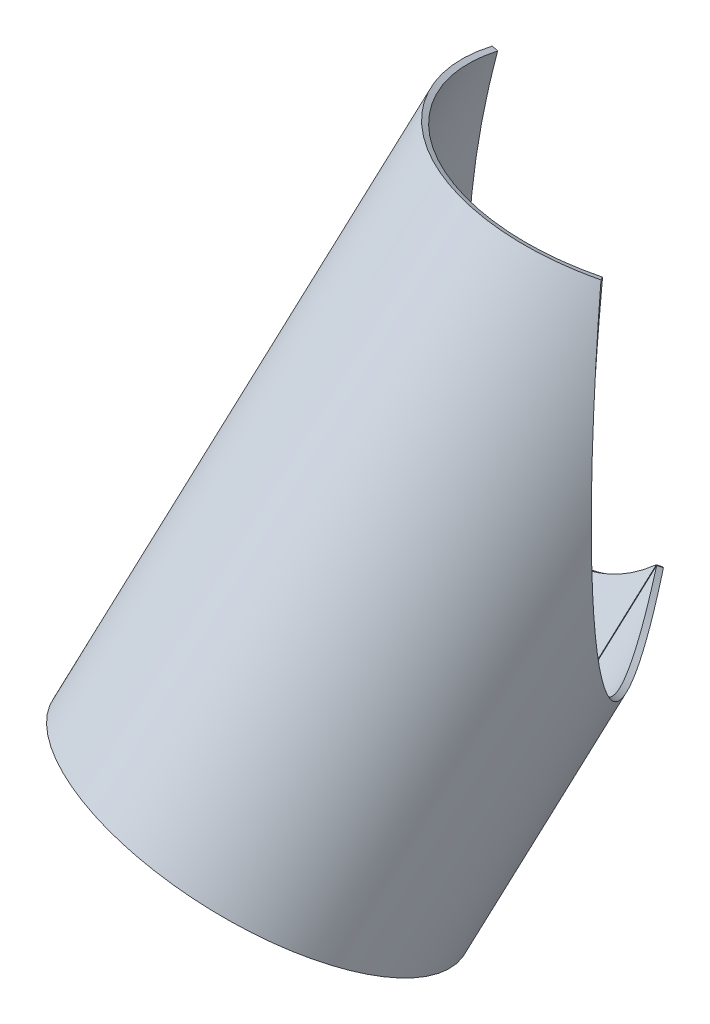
ISO-10303-21;
HEADER;
FILE_DESCRIPTION(('STEP AP214'),'2;1');
FILE_NAME('part.step','',(''),(''),'','','');
FILE_SCHEMA(('AUTOMOTIVE_DESIGN { 1 0 10303 214 1 1 1 1 }'));
ENDSEC;
DATA;
#1=APPLICATION_CONTEXT('core data for automotive mechanical design processes');
#2=APPLICATION_PROTOCOL_DEFINITION('international standard','automotive_design',2000,#1);
#3=PRODUCT_CONTEXT('',#1,'mechanical');
#4=PRODUCT('Part','Part','',(#3));
#5=PRODUCT_RELATED_PRODUCT_CATEGORY('part','',(#4));
#6=PRODUCT_DEFINITION_FORMATION('','',#4);
#7=PRODUCT_DEFINITION_CONTEXT('part definition',#1,'design');
#8=PRODUCT_DEFINITION('design','',#6,#7);
#9=PRODUCT_DEFINITION_SHAPE('','',#8);
#10=(LENGTH_UNIT() NAMED_UNIT(*) SI_UNIT(.MILLI.,.METRE.));
#11=(NAMED_UNIT(*) PLANE_ANGLE_UNIT() SI_UNIT($,.RADIAN.));
#12=(NAMED_UNIT(*) SI_UNIT($,.STERADIAN.) SOLID_ANGLE_UNIT());
#13=UNCERTAINTY_MEASURE_WITH_UNIT(LENGTH_MEASURE(1.E-05),#10,'distance_accuracy_value','');
#14=(GEOMETRIC_REPRESENTATION_CONTEXT(3) GLOBAL_UNCERTAINTY_ASSIGNED_CONTEXT((#13)) GLOBAL_UNIT_ASSIGNED_CONTEXT((#10,
#11,#12)) REPRESENTATION_CONTEXT('',''));
#15=CARTESIAN_POINT('',(0.,0.,0.));
#16=DIRECTION('',(0.,0.,1.));
#17=DIRECTION('',(1.,0.,0.));
#18=AXIS2_PLACEMENT_3D('',#15,#16,#17);
#19=CARTESIAN_POINT('',(-41.2229495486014,-492.249143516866,72.3669097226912));
#20=DIRECTION('',(-0.86481924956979,-0.00138888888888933,-0.502081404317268));
#21=DIRECTION('',(0.250000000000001,0.866025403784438,-0.43301270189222));
#22=AXIS2_PLACEMENT_3D('',#19,#20,#21);
#23=PLANE('',#22);
#24=DIRECTION('',(0.435416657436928,-0.499998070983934,-0.748608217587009));
#25=VECTOR('',#24,1.);
#26=CARTESIAN_POINT('',(-80.1220742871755,-626.999664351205,139.742170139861));
#27=LINE('',#26,#25);
#28=CARTESIAN_POINT('',(-80.1220742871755,-626.999664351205,139.742170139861));
#29=VERTEX_POINT('',#28);
#30=CARTESIAN_POINT('',(-77.509574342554,-629.999652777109,135.250520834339));
#31=VERTEX_POINT('',#30);
#32=EDGE_CURVE('E13',#29,#31,#27,.T.);
#33=ORIENTED_EDGE('',*,*,#32,.F.);
#34=DIRECTION('',(0.250000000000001,0.866025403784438,-0.43301270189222));
#35=VECTOR('',#34,1.);
#36=CARTESIAN_POINT('',(-80.1220742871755,-626.999664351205,139.742170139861));
#37=LINE('',#36,#35);
#38=CARTESIAN_POINT('',(-2.32382481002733,-357.498622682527,4.99164930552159));
#39=VERTEX_POINT('',#38);
#40=EDGE_CURVE('E102',#29,#39,#37,.T.);
#41=ORIENTED_EDGE('',*,*,#40,.T.);
#42=CARTESIAN_POINT('',(0.288675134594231,-360.49861110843,0.499999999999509));
#43=CARTESIAN_POINT('',(-2.32382481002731,-357.498622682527,4.99164930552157));
#44=B_SPLINE_CURVE_WITH_KNOTS('',1,(#42,#43),.UNSPECIFIED.,.F.,.F.,(2,2),(0.,1.),.UNSPECIFIED.);
#45=CARTESIAN_POINT('',(0.288675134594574,-360.498611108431,0.499999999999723));
#46=VERTEX_POINT('',#45);
#47=EDGE_CURVE('E50',#39,#46,#44,.F.);
#48=ORIENTED_EDGE('',*,*,#47,.T.);
#49=DIRECTION('',(0.250000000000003,0.866025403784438,-0.433012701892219));
#50=VECTOR('',#49,1.);
#51=CARTESIAN_POINT('',(-412.667926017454,-1791.02224014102,715.761814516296));
#52=LINE('',#51,#50);
#53=EDGE_CURVE('E101',#31,#46,#52,.T.);
#54=ORIENTED_EDGE('',*,*,#53,.F.);
#55=EDGE_LOOP('',(#33,#41,#48,#54));
#56=FACE_BOUND('',#55,.T.);
#57=ADVANCED_FACE('F40',(#56),#23,.T.);
#58=CARTESIAN_POINT('',(89.9999999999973,24.1154273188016,155.884572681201));
#59=CARTESIAN_POINT('',(91.2305619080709,14.6015895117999,158.01568087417));
#60=CARTESIAN_POINT('',(92.2793208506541,5.89434362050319,159.831258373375));
#61=CARTESIAN_POINT('',(93.4052276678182,-3.9562151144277,161.782152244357));
#62=CARTESIAN_POINT('',(93.6211548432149,-5.87467918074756,162.156330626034));
#63=CARTESIAN_POINT('',(94.0355347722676,-9.60780108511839,162.874305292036));
#64=CARTESIAN_POINT('',(94.2328080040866,-11.4112355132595,163.216015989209));
#65=CARTESIAN_POINT('',(94.8115865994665,-16.7753314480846,164.218407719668));
#66=CARTESIAN_POINT('',(95.1787165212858,-20.2795693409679,164.854120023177));
#67=CARTESIAN_POINT('',(96.2272836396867,-30.5745719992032,166.670007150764));
#68=CARTESIAN_POINT('',(96.8558747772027,-37.1475576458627,167.759054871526));
#69=CARTESIAN_POINT('',(97.7070776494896,-46.56388111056,169.233653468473));
#70=CARTESIAN_POINT('',(97.9754837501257,-49.6270167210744,169.698493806));
#71=CARTESIAN_POINT('',(98.4910837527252,-55.6927130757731,170.591384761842));
#72=CARTESIAN_POINT('',(98.7372619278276,-58.6843475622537,171.017687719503));
#73=CARTESIAN_POINT('',(99.4425217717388,-67.534593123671,172.239121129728));
#74=CARTESIAN_POINT('',(99.8683131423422,-73.2685212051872,172.976817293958));
#75=CARTESIAN_POINT('',(100.447122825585,-81.6164620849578,173.979533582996));
#76=CARTESIAN_POINT('',(100.629930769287,-84.3540531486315,174.296153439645));
#77=CARTESIAN_POINT('',(100.97886351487,-89.77999703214,174.900420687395));
#78=CARTESIAN_POINT('',(101.144695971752,-92.4644374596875,175.187578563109));
#79=CARTESIAN_POINT('',(101.617204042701,-100.431564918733,176.005850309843));
#80=CARTESIAN_POINT('',(101.898880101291,-105.628045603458,176.493781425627));
#81=CARTESIAN_POINT('',(102.400712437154,-115.788244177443,177.363218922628));
#82=CARTESIAN_POINT('',(102.620661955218,-120.7439217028,177.744211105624));
#83=CARTESIAN_POINT('',(103.199692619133,-135.361714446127,178.746834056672));
#84=CARTESIAN_POINT('',(103.476164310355,-144.750517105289,179.225898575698));
#85=CARTESIAN_POINT('',(103.837018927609,-162.800269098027,179.851056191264));
#86=CARTESIAN_POINT('',(103.922883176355,-171.520550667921,179.999114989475));
#87=CARTESIAN_POINT('',(103.923479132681,-188.378757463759,180.000418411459));
#88=CARTESIAN_POINT('',(103.838580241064,-196.502774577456,179.853945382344));
#89=CARTESIAN_POINT('',(103.513637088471,-212.243098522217,179.290946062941));
#90=CARTESIAN_POINT('',(103.273205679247,-219.848690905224,178.874529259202));
#91=CARTESIAN_POINT('',(102.650378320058,-234.522832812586,177.795725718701));
#92=CARTESIAN_POINT('',(102.267189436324,-241.61204324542,177.13172423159));
#93=CARTESIAN_POINT('',(101.367833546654,-255.294456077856,175.574077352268));
#94=CARTESIAN_POINT('',(100.852290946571,-261.880986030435,174.681305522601));
#95=CARTESIAN_POINT('',(99.6975115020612,-274.578174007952,172.680842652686));
#96=CARTESIAN_POINT('',(99.0576015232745,-280.693444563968,171.572419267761));
#97=CARTESIAN_POINT('',(97.6618429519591,-292.45195212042,169.155216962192));
#98=CARTESIAN_POINT('',(96.9067335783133,-298.090681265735,167.847480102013));
#99=CARTESIAN_POINT('',(94.4768575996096,-314.326827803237,163.638044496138));
#100=CARTESIAN_POINT('',(92.6345158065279,-324.255648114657,160.447582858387));
#101=CARTESIAN_POINT('',(88.566682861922,-342.288694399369,153.402018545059));
#102=CARTESIAN_POINT('',(86.3332696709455,-350.429090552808,149.532735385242));
#103=CARTESIAN_POINT('',(81.5150092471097,-364.937653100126,141.18820095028));
#104=CARTESIAN_POINT('',(78.9322063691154,-371.302582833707,136.7145132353));
#105=CARTESIAN_POINT('',(73.4484188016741,-382.28312236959,127.216481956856));
#106=CARTESIAN_POINT('',(70.5471857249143,-386.897387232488,122.191374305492));
#107=CARTESIAN_POINT('',(61.4199371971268,-398.100905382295,106.382340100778));
#108=CARTESIAN_POINT('',(54.7608308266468,-402.06781445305,94.8486982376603));
#109=CARTESIAN_POINT('',(44.0925509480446,-402.656028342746,76.3704085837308));
#110=CARTESIAN_POINT('',(40.4234550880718,-401.958421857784,70.0154635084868));
#111=CARTESIAN_POINT('',(32.8832628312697,-398.743388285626,56.9553360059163));
#112=CARTESIAN_POINT('',(29.0144514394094,-396.227748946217,50.2541894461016));
#113=CARTESIAN_POINT('',(21.0942669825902,-389.32425307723,36.535374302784));
#114=CARTESIAN_POINT('',(17.0485787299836,-384.942064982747,29.5290203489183));
#115=CARTESIAN_POINT('',(10.8778278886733,-376.935588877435,18.8410771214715));
#116=CARTESIAN_POINT('',(8.80179622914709,-374.024918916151,15.245164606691));
#117=CARTESIAN_POINT('',(5.6687966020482,-369.300957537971,9.81865777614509));
#118=CARTESIAN_POINT('',(4.62233250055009,-367.668357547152,8.00620817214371));
#119=CARTESIAN_POINT('',(3.04875124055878,-365.130142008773,5.28052739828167));
#120=CARTESIAN_POINT('',(2.5249251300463,-364.27167339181,4.37328826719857));
#121=CARTESIAN_POINT('',(1.46777958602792,-362.510832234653,2.5421426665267));
#122=CARTESIAN_POINT('',(0.899027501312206,-361.547197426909,1.5553567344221));
#123=CARTESIAN_POINT('',(0.288675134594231,-360.49861110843,0.499999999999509));
#124=CARTESIAN_POINT('',(86.7990381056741,22.6154273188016,151.036496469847));
#125=CARTESIAN_POINT('',(87.9147940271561,13.1631197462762,153.224368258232));
#126=CARTESIAN_POINT('',(88.8613894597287,4.51330199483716,155.095831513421));
#127=CARTESIAN_POINT('',(89.8739817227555,-5.27142939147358,157.112957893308));
#128=CARTESIAN_POINT('',(90.0679656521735,-7.17702516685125,157.500203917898));
#129=CARTESIAN_POINT('',(90.4398639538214,-10.8850218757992,158.243902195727));
#130=CARTESIAN_POINT('',(90.6167241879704,-12.6762753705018,158.598189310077));
#131=CARTESIAN_POINT('',(91.1350868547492,-18.0040234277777,159.638395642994));
#132=CARTESIAN_POINT('',(91.4631603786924,-21.4843562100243,160.299368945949));
#133=CARTESIAN_POINT('',(92.3981094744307,-31.7086983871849,162.190979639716));
#134=CARTESIAN_POINT('',(92.9556909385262,-38.2359857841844,163.330426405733));
#135=CARTESIAN_POINT('',(93.7070162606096,-47.5861293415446,164.879720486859));
#136=CARTESIAN_POINT('',(93.9432510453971,-50.6276122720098,165.369292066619));
#137=CARTESIAN_POINT('',(94.3957412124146,-56.6502012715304,166.311961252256));
#138=CARTESIAN_POINT('',(94.6110977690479,-59.6204576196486,166.763225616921));
#139=CARTESIAN_POINT('',(95.2260396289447,-68.4071292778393,168.059661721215));
#140=CARTESIAN_POINT('',(95.5944820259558,-74.0994229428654,168.847516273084));
#141=CARTESIAN_POINT('',(96.0913395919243,-82.3861544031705,169.925336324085));
#142=CARTESIAN_POINT('',(96.2475354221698,-85.1035706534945,170.266941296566));
#143=CARTESIAN_POINT('',(96.5442251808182,-90.4893334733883,170.921408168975));
#144=CARTESIAN_POINT('',(96.6844659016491,-93.1537962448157,171.233745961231));
#145=CARTESIAN_POINT('',(97.0817576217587,-101.061349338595,172.127740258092));
#146=CARTESIAN_POINT('',(97.3153682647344,-106.218592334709,172.666396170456));
#147=CARTESIAN_POINT('',(97.7250561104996,-116.301368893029,173.637478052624));
#148=CARTESIAN_POINT('',(97.9009928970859,-121.218924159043,174.069303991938));
#149=CARTESIAN_POINT('',(98.3528161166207,-135.72325595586,175.225405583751));
#150=CARTESIAN_POINT('',(98.5511615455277,-145.037811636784,175.807857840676));
#151=CARTESIAN_POINT('',(98.7682207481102,-162.942359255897,176.640403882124));
#152=CARTESIAN_POINT('',(98.7879342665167,-171.591202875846,176.893146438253));
#153=CARTESIAN_POINT('',(98.6668432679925,-188.308936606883,177.105139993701));
#154=CARTESIAN_POINT('',(98.5264959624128,-196.364035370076,177.064490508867));
#155=CARTESIAN_POINT('',(98.1001428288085,-211.968497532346,176.714665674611));
#156=CARTESIAN_POINT('',(97.8138388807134,-219.507239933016,176.405464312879));
#157=CARTESIAN_POINT('',(97.10846617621,-234.050107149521,175.541552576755));
#158=CARTESIAN_POINT('',(96.6884859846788,-241.074706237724,174.985532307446));
#159=CARTESIAN_POINT('',(95.7241113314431,-254.630118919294,173.644347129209));
#160=CARTESIAN_POINT('',(95.1803667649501,-261.154322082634,172.859946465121));
#161=CARTESIAN_POINT('',(93.9772586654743,-273.729028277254,171.076544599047));
#162=CARTESIAN_POINT('',(93.3172123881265,-279.784101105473,170.076890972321));
#163=CARTESIAN_POINT('',(91.8889338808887,-291.42447908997,167.877172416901));
#164=CARTESIAN_POINT('',(91.1214465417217,-297.00532164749,166.678062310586));
#165=CARTESIAN_POINT('',(88.6655193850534,-313.071085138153,162.794352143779));
#166=CARTESIAN_POINT('',(86.820608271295,-322.890580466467,159.821057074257));
#167=CARTESIAN_POINT('',(82.7751762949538,-340.714638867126,153.206401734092));
#168=CARTESIAN_POINT('',(80.5667710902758,-348.754950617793,149.55172574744));
#169=CARTESIAN_POINT('',(75.8244855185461,-363.073074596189,141.631932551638));
#170=CARTESIAN_POINT('',(73.2926033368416,-369.347681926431,137.368288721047));
#171=CARTESIAN_POINT('',(67.9352119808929,-380.157567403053,128.284540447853));
#172=CARTESIAN_POINT('',(65.1094746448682,-384.691504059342,123.463676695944));
#173=CARTESIAN_POINT('',(56.243644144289,-395.669916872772,108.255782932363));
#174=CARTESIAN_POINT('',(49.8056245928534,-399.507655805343,97.1081258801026));
#175=CARTESIAN_POINT('',(39.5331611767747,-399.936980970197,79.1761384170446));
#176=CARTESIAN_POINT('',(36.0066905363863,-399.1922304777,72.9978260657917));
#177=CARTESIAN_POINT('',(28.7724584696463,-395.89515390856,60.2784307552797));
#178=CARTESIAN_POINT('',(25.0668831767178,-393.344634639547,53.7412884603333));
#179=CARTESIAN_POINT('',(17.4935296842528,-386.384341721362,40.3363103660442));
#180=CARTESIAN_POINT('',(13.6311769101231,-381.980289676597,33.479533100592));
#181=CARTESIAN_POINT('',(7.74961058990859,-373.951468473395,23.0032408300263));
#182=CARTESIAN_POINT('',(5.77243650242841,-371.035087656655,19.4758254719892));
#183=CARTESIAN_POINT('',(2.79101658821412,-366.305271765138,14.1485422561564));
#184=CARTESIAN_POINT('',(1.79557687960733,-364.671173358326,12.3685484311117));
#185=CARTESIAN_POINT('',(0.299323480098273,-362.131394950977,9.69063865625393));
#186=CARTESIAN_POINT('',(-0.198663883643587,-361.272520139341,8.79912992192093));
#187=CARTESIAN_POINT('',(-1.20345827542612,-359.51109262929,6.99938197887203));
#188=CARTESIAN_POINT('',(-1.74392169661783,-358.547257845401,6.02932831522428));
#189=CARTESIAN_POINT('',(-2.32382481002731,-357.498622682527,4.99164930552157));
#190=B_SPLINE_SURFACE_WITH_KNOTS('',1,3,((#58,#59,#60,#61,#62,#63,#64,#65,#66,#67,#68,#69,#70,
#71,#72,#73,#74,#75,#76,#77,#78,#79,#80,#81,#82,#83,#84,#85,#86,#87,#88,#89,#90,#91,#92,#93,#94,
#95,#96,#97,#98,#99,#100,#101,#102,#103,#104,#105,#106,#107,#108,#109,#110,#111,#112,#113,#114,
#115,#116,#117,#118,#119,#120,#121,#122,#123),(#124,#125,#126,#127,#128,#129,#130,#131,#132,
#133,#134,#135,#136,#137,#138,#139,#140,#141,#142,#143,#144,#145,#146,#147,#148,#149,#150,#151,
#152,#153,#154,#155,#156,#157,#158,#159,#160,#161,#162,#163,#164,#165,#166,#167,#168,#169,#170,
#171,#172,#173,#174,#175,#176,#177,#178,#179,#180,#181,#182,#183,#184,#185,#186,#187,#188,
#189)),.UNSPECIFIED.,.F.,.F.,.F.,(2,2),(4,2,2,2,2,2,2,2,2,2,2,2,2,2,2,2,2,2,2,2,2,2,2,2,2,2,2,2,
2,2,2,2,4),(0.,1.),(0.,0.015625,0.01953125,0.0234375,0.03125,0.046875,0.0546875,0.0625,0.078125,
0.0859375,0.09375,0.109375,0.125,0.15625,0.1875,0.21875,0.25,0.28125,0.3125,0.34375,0.375,
0.4375,0.5,0.5625,0.625,0.75,0.8125,0.875,0.9375,0.96875,0.984375,0.9921875,1.),.UNSPECIFIED.);
#191=CARTESIAN_POINT('',(-2.32382481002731,-357.498622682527,4.99164930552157));
#192=CARTESIAN_POINT('',(-1.74392169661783,-358.547257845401,6.02932831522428));
#193=CARTESIAN_POINT('',(-1.20345827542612,-359.51109262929,6.99938197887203));
#194=CARTESIAN_POINT('',(-0.198663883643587,-361.272520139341,8.79912992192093));
#195=CARTESIAN_POINT('',(0.299323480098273,-362.131394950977,9.69063865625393));
#196=CARTESIAN_POINT('',(1.79557687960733,-364.671173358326,12.3685484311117));
#197=CARTESIAN_POINT('',(2.79101658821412,-366.305271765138,14.1485422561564));
#198=CARTESIAN_POINT('',(5.77243650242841,-371.035087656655,19.4758254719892));
#199=CARTESIAN_POINT('',(7.74961058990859,-373.951468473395,23.0032408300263));
#200=CARTESIAN_POINT('',(13.6311769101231,-381.980289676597,33.479533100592));
#201=CARTESIAN_POINT('',(17.4935296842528,-386.384341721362,40.3363103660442));
#202=CARTESIAN_POINT('',(25.0668831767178,-393.344634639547,53.7412884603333));
#203=CARTESIAN_POINT('',(28.7724584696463,-395.89515390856,60.2784307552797));
#204=CARTESIAN_POINT('',(36.0066905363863,-399.1922304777,72.9978260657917));
#205=CARTESIAN_POINT('',(39.5331611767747,-399.936980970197,79.1761384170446));
#206=CARTESIAN_POINT('',(49.8056245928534,-399.507655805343,97.1081258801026));
#207=CARTESIAN_POINT('',(56.243644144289,-395.669916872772,108.255782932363));
#208=CARTESIAN_POINT('',(65.1094746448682,-384.691504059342,123.463676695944));
#209=CARTESIAN_POINT('',(67.9352119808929,-380.157567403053,128.284540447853));
#210=CARTESIAN_POINT('',(73.2926033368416,-369.347681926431,137.368288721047));
#211=CARTESIAN_POINT('',(75.8244855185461,-363.073074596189,141.631932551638));
#212=CARTESIAN_POINT('',(80.5667710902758,-348.754950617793,149.55172574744));
#213=CARTESIAN_POINT('',(82.7751762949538,-340.714638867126,153.206401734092));
#214=CARTESIAN_POINT('',(86.820608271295,-322.890580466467,159.821057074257));
#215=CARTESIAN_POINT('',(88.6655193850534,-313.071085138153,162.794352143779));
#216=CARTESIAN_POINT('',(91.1214465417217,-297.00532164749,166.678062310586));
#217=CARTESIAN_POINT('',(91.8889338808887,-291.42447908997,167.877172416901));
#218=CARTESIAN_POINT('',(93.3172123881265,-279.784101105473,170.076890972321));
#219=CARTESIAN_POINT('',(93.9772586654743,-273.729028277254,171.076544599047));
#220=CARTESIAN_POINT('',(95.1803667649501,-261.154322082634,172.859946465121));
#221=CARTESIAN_POINT('',(95.7241113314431,-254.630118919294,173.644347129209));
#222=CARTESIAN_POINT('',(96.6884859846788,-241.074706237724,174.985532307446));
#223=CARTESIAN_POINT('',(97.10846617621,-234.050107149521,175.541552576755));
#224=CARTESIAN_POINT('',(97.8138388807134,-219.507239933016,176.405464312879));
#225=CARTESIAN_POINT('',(98.1001428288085,-211.968497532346,176.714665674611));
#226=CARTESIAN_POINT('',(98.5264959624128,-196.364035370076,177.064490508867));
#227=CARTESIAN_POINT('',(98.6668432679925,-188.308936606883,177.105139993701));
#228=CARTESIAN_POINT('',(98.7879342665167,-171.591202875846,176.893146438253));
#229=CARTESIAN_POINT('',(98.7682207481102,-162.942359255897,176.640403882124));
#230=CARTESIAN_POINT('',(98.5511615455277,-145.037811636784,175.807857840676));
#231=CARTESIAN_POINT('',(98.3528161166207,-135.72325595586,175.225405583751));
#232=CARTESIAN_POINT('',(97.9009928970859,-121.218924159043,174.069303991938));
#233=CARTESIAN_POINT('',(97.7250561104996,-116.301368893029,173.637478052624));
#234=CARTESIAN_POINT('',(97.3153682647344,-106.218592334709,172.666396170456));
#235=CARTESIAN_POINT('',(97.0817576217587,-101.061349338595,172.127740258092));
#236=CARTESIAN_POINT('',(96.6844659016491,-93.1537962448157,171.233745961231));
#237=CARTESIAN_POINT('',(96.5442251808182,-90.4893334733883,170.921408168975));
#238=CARTESIAN_POINT('',(96.2475354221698,-85.1035706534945,170.266941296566));
#239=CARTESIAN_POINT('',(96.0913395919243,-82.3861544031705,169.925336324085));
#240=CARTESIAN_POINT('',(95.5944820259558,-74.0994229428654,168.847516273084));
#241=CARTESIAN_POINT('',(95.2260396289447,-68.4071292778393,168.059661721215));
#242=CARTESIAN_POINT('',(94.6110977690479,-59.6204576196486,166.763225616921));
#243=CARTESIAN_POINT('',(94.3957412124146,-56.6502012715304,166.311961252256));
#244=CARTESIAN_POINT('',(93.9432510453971,-50.6276122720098,165.369292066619));
#245=CARTESIAN_POINT('',(93.7070162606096,-47.5861293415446,164.879720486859));
#246=CARTESIAN_POINT('',(92.9556909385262,-38.2359857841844,163.330426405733));
#247=CARTESIAN_POINT('',(92.3981094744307,-31.7086983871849,162.190979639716));
#248=CARTESIAN_POINT('',(91.4631603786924,-21.4843562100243,160.299368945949));
#249=CARTESIAN_POINT('',(91.1350868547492,-18.0040234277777,159.638395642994));
#250=CARTESIAN_POINT('',(90.6167241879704,-12.6762753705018,158.598189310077));
#251=CARTESIAN_POINT('',(90.4398639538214,-10.8850218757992,158.243902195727));
#252=CARTESIAN_POINT('',(90.0679656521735,-7.17702516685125,157.500203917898));
#253=CARTESIAN_POINT('',(89.8739817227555,-5.27142939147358,157.112957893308));
#254=CARTESIAN_POINT('',(88.8613894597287,4.51330199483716,155.095831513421));
#255=CARTESIAN_POINT('',(87.9147940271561,13.1631197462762,153.224368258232));
#256=CARTESIAN_POINT('',(86.7990381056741,22.6154273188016,151.036496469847));
#257=B_SPLINE_CURVE_WITH_KNOTS('',3,(#191,#192,#193,#194,#195,#196,#197,#198,#199,#200,#201,
#202,#203,#204,#205,#206,#207,#208,#209,#210,#211,#212,#213,#214,#215,#216,#217,#218,#219,#220,
#221,#222,#223,#224,#225,#226,#227,#228,#229,#230,#231,#232,#233,#234,#235,#236,#237,#238,#239,
#240,#241,#242,#243,#244,#245,#246,#247,#248,#249,#250,#251,#252,#253,#254,#255,#256),
.UNSPECIFIED.,.F.,.F.,(4,2,2,2,2,2,2,2,2,2,2,2,2,2,2,2,2,2,2,2,2,2,2,2,2,2,2,2,2,2,2,2,4),(0.,
0.0078125,0.015625,0.03125,0.0625,0.125,0.1875,0.25,0.375,0.4375,0.5,0.5625,0.625,0.65625,
0.6875,0.71875,0.75,0.78125,0.8125,0.84375,0.875,0.890625,0.90625,0.9140625,0.921875,0.9375,
0.9453125,0.953125,0.96875,0.9765625,0.98046875,0.984375,1.),.UNSPECIFIED.);
#258=CARTESIAN_POINT('',(86.799038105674,22.6154273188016,151.036496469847));
#259=VERTEX_POINT('',#258);
#260=EDGE_CURVE('E187',#259,#39,#257,.F.);
#261=CARTESIAN_POINT('',(86.7990381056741,22.6154273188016,151.036496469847));
#262=CARTESIAN_POINT('',(89.9999999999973,24.1154273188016,155.884572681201));
#263=B_SPLINE_CURVE_WITH_KNOTS('',1,(#261,#262),.UNSPECIFIED.,.F.,.F.,(2,2),(0.,1.),.UNSPECIFIED.);
#264=CARTESIAN_POINT('',(90.0000000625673,24.1154268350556,155.88457278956));
#265=VERTEX_POINT('',#264);
#266=EDGE_CURVE('E108',#259,#265,#263,.T.);
#267=CARTESIAN_POINT('',(89.9999999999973,24.1154273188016,155.884572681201));
#268=CARTESIAN_POINT('',(91.2305619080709,14.6015895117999,158.01568087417));
#269=CARTESIAN_POINT('',(92.2793208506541,5.89434362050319,159.831258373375));
#270=CARTESIAN_POINT('',(93.4052276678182,-3.9562151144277,161.782152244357));
#271=CARTESIAN_POINT('',(93.6211548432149,-5.87467918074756,162.156330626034));
#272=CARTESIAN_POINT('',(94.0355347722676,-9.60780108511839,162.874305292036));
#273=CARTESIAN_POINT('',(94.2328080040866,-11.4112355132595,163.216015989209));
#274=CARTESIAN_POINT('',(94.8115865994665,-16.7753314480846,164.218407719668));
#275=CARTESIAN_POINT('',(95.1787165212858,-20.2795693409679,164.854120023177));
#276=CARTESIAN_POINT('',(96.2272836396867,-30.5745719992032,166.670007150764));
#277=CARTESIAN_POINT('',(96.8558747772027,-37.1475576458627,167.759054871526));
#278=CARTESIAN_POINT('',(97.7070776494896,-46.56388111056,169.233653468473));
#279=CARTESIAN_POINT('',(97.9754837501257,-49.6270167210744,169.698493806));
#280=CARTESIAN_POINT('',(98.4910837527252,-55.6927130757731,170.591384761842));
#281=CARTESIAN_POINT('',(98.7372619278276,-58.6843475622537,171.017687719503));
#282=CARTESIAN_POINT('',(99.4425217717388,-67.534593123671,172.239121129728));
#283=CARTESIAN_POINT('',(99.8683131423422,-73.2685212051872,172.976817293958));
#284=CARTESIAN_POINT('',(100.447122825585,-81.6164620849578,173.979533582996));
#285=CARTESIAN_POINT('',(100.629930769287,-84.3540531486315,174.296153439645));
#286=CARTESIAN_POINT('',(100.97886351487,-89.77999703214,174.900420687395));
#287=CARTESIAN_POINT('',(101.144695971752,-92.4644374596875,175.187578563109));
#288=CARTESIAN_POINT('',(101.617204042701,-100.431564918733,176.005850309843));
#289=CARTESIAN_POINT('',(101.898880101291,-105.628045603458,176.493781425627));
#290=CARTESIAN_POINT('',(102.400712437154,-115.788244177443,177.363218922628));
#291=CARTESIAN_POINT('',(102.620661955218,-120.7439217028,177.744211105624));
#292=CARTESIAN_POINT('',(103.199692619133,-135.361714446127,178.746834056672));
#293=CARTESIAN_POINT('',(103.476164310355,-144.750517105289,179.225898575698));
#294=CARTESIAN_POINT('',(103.837018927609,-162.800269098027,179.851056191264));
#295=CARTESIAN_POINT('',(103.922883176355,-171.520550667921,179.999114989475));
#296=CARTESIAN_POINT('',(103.923479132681,-188.378757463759,180.000418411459));
#297=CARTESIAN_POINT('',(103.838580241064,-196.502774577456,179.853945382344));
#298=CARTESIAN_POINT('',(103.513637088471,-212.243098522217,179.290946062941));
#299=CARTESIAN_POINT('',(103.273205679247,-219.848690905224,178.874529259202));
#300=CARTESIAN_POINT('',(102.650378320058,-234.522832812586,177.795725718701));
#301=CARTESIAN_POINT('',(102.267189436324,-241.61204324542,177.13172423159));
#302=CARTESIAN_POINT('',(101.367833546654,-255.294456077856,175.574077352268));
#303=CARTESIAN_POINT('',(100.852290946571,-261.880986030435,174.681305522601));
#304=CARTESIAN_POINT('',(99.6975115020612,-274.578174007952,172.680842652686));
#305=CARTESIAN_POINT('',(99.0576015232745,-280.693444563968,171.572419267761));
#306=CARTESIAN_POINT('',(97.6618429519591,-292.45195212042,169.155216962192));
#307=CARTESIAN_POINT('',(96.9067335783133,-298.090681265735,167.847480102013));
#308=CARTESIAN_POINT('',(94.4768575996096,-314.326827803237,163.638044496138));
#309=CARTESIAN_POINT('',(92.6345158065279,-324.255648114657,160.447582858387));
#310=CARTESIAN_POINT('',(88.566682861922,-342.288694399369,153.402018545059));
#311=CARTESIAN_POINT('',(86.3332696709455,-350.429090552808,149.532735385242));
#312=CARTESIAN_POINT('',(81.5150092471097,-364.937653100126,141.18820095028));
#313=CARTESIAN_POINT('',(78.9322063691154,-371.302582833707,136.7145132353));
#314=CARTESIAN_POINT('',(73.4484188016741,-382.28312236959,127.216481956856));
#315=CARTESIAN_POINT('',(70.5471857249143,-386.897387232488,122.191374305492));
#316=CARTESIAN_POINT('',(61.4199371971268,-398.100905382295,106.382340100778));
#317=CARTESIAN_POINT('',(54.7608308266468,-402.06781445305,94.8486982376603));
#318=CARTESIAN_POINT('',(44.0925509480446,-402.656028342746,76.3704085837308));
#319=CARTESIAN_POINT('',(40.4234550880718,-401.958421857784,70.0154635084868));
#320=CARTESIAN_POINT('',(32.8832628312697,-398.743388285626,56.9553360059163));
#321=CARTESIAN_POINT('',(29.0144514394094,-396.227748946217,50.2541894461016));
#322=CARTESIAN_POINT('',(21.0942669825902,-389.32425307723,36.535374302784));
#323=CARTESIAN_POINT('',(17.0485787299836,-384.942064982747,29.5290203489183));
#324=CARTESIAN_POINT('',(10.8778278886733,-376.935588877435,18.8410771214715));
#325=CARTESIAN_POINT('',(8.80179622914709,-374.024918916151,15.245164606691));
#326=CARTESIAN_POINT('',(5.6687966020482,-369.300957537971,9.81865777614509));
#327=CARTESIAN_POINT('',(4.62233250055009,-367.668357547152,8.00620817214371));
#328=CARTESIAN_POINT('',(3.04875124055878,-365.130142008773,5.28052739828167));
#329=CARTESIAN_POINT('',(2.5249251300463,-364.27167339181,4.37328826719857));
#330=CARTESIAN_POINT('',(1.46777958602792,-362.510832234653,2.5421426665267));
#331=CARTESIAN_POINT('',(0.899027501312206,-361.547197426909,1.5553567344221));
#332=CARTESIAN_POINT('',(0.288675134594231,-360.49861110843,0.499999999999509));
#333=B_SPLINE_CURVE_WITH_KNOTS('',3,(#267,#268,#269,#270,#271,#272,#273,#274,#275,#276,#277,
#278,#279,#280,#281,#282,#283,#284,#285,#286,#287,#288,#289,#290,#291,#292,#293,#294,#295,#296,
#297,#298,#299,#300,#301,#302,#303,#304,#305,#306,#307,#308,#309,#310,#311,#312,#313,#314,#315,
#316,#317,#318,#319,#320,#321,#322,#323,#324,#325,#326,#327,#328,#329,#330,#331,#332),
.UNSPECIFIED.,.F.,.F.,(4,2,2,2,2,2,2,2,2,2,2,2,2,2,2,2,2,2,2,2,2,2,2,2,2,2,2,2,2,2,2,2,4),(0.,
0.015625,0.01953125,0.0234375,0.03125,0.046875,0.0546875,0.0625,0.078125,0.0859375,0.09375,
0.109375,0.125,0.15625,0.1875,0.21875,0.25,0.28125,0.3125,0.34375,0.375,0.4375,0.5,0.5625,0.625,
0.75,0.8125,0.875,0.9375,0.96875,0.984375,0.9921875,1.),.UNSPECIFIED.);
#334=EDGE_CURVE('E116',#265,#46,#333,.T.);
#335=ORIENTED_EDGE('',*,*,#47,.F.);
#336=ORIENTED_EDGE('',*,*,#260,.F.);
#337=ORIENTED_EDGE('',*,*,#266,.T.);
#338=ORIENTED_EDGE('',*,*,#334,.T.);
#339=EDGE_LOOP('',(#335,#336,#337,#338));
#340=FACE_BOUND('',#339,.T.);
#341=ADVANCED_FACE('F121',(#340),#190,.F.);
#342=CARTESIAN_POINT('',(-180.,24.1154273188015,-2.6717452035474E-12));
#343=CARTESIAN_POINT('',(-179.999838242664,24.5886651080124,2.03667652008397));
#344=CARTESIAN_POINT('',(-179.965279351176,25.0446003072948,4.02139110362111));
#345=CARTESIAN_POINT('',(-179.869465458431,25.7038587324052,6.91876385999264));
#346=CARTESIAN_POINT('',(-179.830194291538,25.9195049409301,7.87127411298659));
#347=CARTESIAN_POINT('',(-179.761203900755,26.2369876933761,9.27993622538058));
#348=CARTESIAN_POINT('',(-179.736526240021,26.3418175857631,9.7461400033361));
#349=CARTESIAN_POINT('',(-179.69710063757,26.4975881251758,10.4403999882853));
#350=CARTESIAN_POINT('',(-179.683557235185,26.5492659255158,10.6709790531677));
#351=CARTESIAN_POINT('',(-179.66265370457,26.6264168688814,11.0155838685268));
#352=CARTESIAN_POINT('',(-179.65558778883,26.6520728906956,11.1302415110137));
#353=CARTESIAN_POINT('',(-179.644843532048,26.6904658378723,11.3019117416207));
#354=CARTESIAN_POINT('',(-179.641237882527,26.7032483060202,11.3590824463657));
#355=CARTESIAN_POINT('',(-179.633978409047,26.7287829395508,11.4733183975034));
#356=CARTESIAN_POINT('',(-179.630601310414,26.7405767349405,11.5260938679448));
#357=CARTESIAN_POINT('',(-179.500103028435,27.1925253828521,13.5490687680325));
#358=CARTESIAN_POINT('',(-179.342355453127,27.6227651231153,15.4941943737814));
#359=CARTESIAN_POINT('',(-179.061171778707,28.2560702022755,18.3856984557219));
#360=CARTESIAN_POINT('',(-178.960016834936,28.4651634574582,19.3451703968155));
#361=CARTESIAN_POINT('',(-178.797423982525,28.7757921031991,20.7776752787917));
#362=CARTESIAN_POINT('',(-178.741416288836,28.8788331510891,21.254059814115));
#363=CARTESIAN_POINT('',(-178.654724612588,29.0326424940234,21.9669418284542));
#364=CARTESIAN_POINT('',(-178.62538069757,29.0837869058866,22.2042867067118));
#365=CARTESIAN_POINT('',(-178.58069915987,29.1603155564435,22.5598779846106));
#366=CARTESIAN_POINT('',(-178.565694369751,29.1857937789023,22.6783374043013));
#367=CARTESIAN_POINT('',(-178.535463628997,29.2366875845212,22.9151138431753));
#368=CARTESIAN_POINT('',(-178.520910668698,29.260989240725,23.028241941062));
#369=CARTESIAN_POINT('',(-177.992608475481,30.1354298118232,27.1015820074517));
#370=CARTESIAN_POINT('',(-177.355356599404,30.9516819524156,30.9867298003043));
#371=CARTESIAN_POINT('',(-176.228124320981,32.128095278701,36.7071698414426));
#372=CARTESIAN_POINT('',(-175.823821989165,32.5122480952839,38.5961208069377));
#373=CARTESIAN_POINT('',(-175.176541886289,33.0765252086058,41.4016434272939));
#374=CARTESIAN_POINT('',(-174.953977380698,33.2626260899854,42.3321680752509));
#375=CARTESIAN_POINT('',(-174.610174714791,33.5387979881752,43.7208515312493));
#376=CARTESIAN_POINT('',(-174.493914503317,33.6303587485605,44.1825621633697));
#377=CARTESIAN_POINT('',(-174.31706650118,33.7669563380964,44.8733367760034));
#378=CARTESIAN_POINT('',(-174.257707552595,33.8123649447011,45.1032964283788));
#379=CARTESIAN_POINT('',(-174.168058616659,33.8802921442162,45.4477861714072));
#380=CARTESIAN_POINT('',(-174.138073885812,33.9029035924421,45.5625411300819));
#381=CARTESIAN_POINT('',(-174.077901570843,33.9480646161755,45.7919008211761));
#382=CARTESIAN_POINT('',(-174.049174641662,33.9695282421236,45.9009824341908));
#383=CARTESIAN_POINT('',(-173.001446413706,34.7484801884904,49.8627176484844));
#384=CARTESIAN_POINT('',(-171.866914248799,35.472607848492,53.6376541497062));
#385=CARTESIAN_POINT('',(-170.000685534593,36.5112656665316,59.1907952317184));
#386=CARTESIAN_POINT('',(-169.351206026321,36.8495699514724,61.0236451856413));
#387=CARTESIAN_POINT('',(-168.337567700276,37.3451292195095,63.7446018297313));
#388=CARTESIAN_POINT('',(-167.993118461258,37.5083332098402,64.6468684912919));
#389=CARTESIAN_POINT('',(-167.466800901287,37.7501662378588,65.9930697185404));
#390=CARTESIAN_POINT('',(-167.289754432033,37.8302817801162,66.4406037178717));
#391=CARTESIAN_POINT('',(-167.021800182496,37.9497122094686,67.1100905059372));
#392=CARTESIAN_POINT('',(-166.932084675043,37.9893985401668,67.3329504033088));
#393=CARTESIAN_POINT('',(-166.796918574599,38.0487423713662,67.6667849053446));
#394=CARTESIAN_POINT('',(-166.751764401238,38.0684927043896,67.7779871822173));
#395=CARTESIAN_POINT('',(-166.661258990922,38.1079314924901,68.0002396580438));
#396=CARTESIAN_POINT('',(-166.617497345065,38.1269324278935,68.107408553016));
#397=CARTESIAN_POINT('',(-165.065207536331,38.7983187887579,71.8976339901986));
#398=CARTESIAN_POINT('',(-163.447262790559,39.417817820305,75.5009419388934));
#399=CARTESIAN_POINT('',(-160.863107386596,40.2988604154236,80.7892112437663));
#400=CARTESIAN_POINT('',(-159.975518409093,40.5845130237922,82.5325295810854));
#401=CARTESIAN_POINT('',(-158.606323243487,41.0008911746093,85.1173705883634));
#402=CARTESIAN_POINT('',(-158.143623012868,41.1376674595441,85.9739621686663));
#403=CARTESIAN_POINT('',(-157.440307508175,41.3398031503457,87.251199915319));
#404=CARTESIAN_POINT('',(-157.204324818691,41.4066769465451,87.6756709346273));
#405=CARTESIAN_POINT('',(-156.8480579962,41.5062301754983,88.310450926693));
#406=CARTESIAN_POINT('',(-156.728920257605,41.5392883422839,88.521723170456));
#407=CARTESIAN_POINT('',(-156.549643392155,41.5886862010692,88.8381481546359));
#408=CARTESIAN_POINT('',(-156.489789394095,41.6051205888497,88.9435425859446));
#409=CARTESIAN_POINT('',(-156.36989180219,41.6379262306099,89.1541700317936));
#410=CARTESIAN_POINT('',(-156.312035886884,41.6537030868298,89.2555778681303));
#411=CARTESIAN_POINT('',(-152.260857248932,42.7544185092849,96.3391049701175));
#412=CARTESIAN_POINT('',(-147.839017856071,43.7049241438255,102.98482898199));
#413=CARTESIAN_POINT('',(-140.650207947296,44.9259416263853,112.396580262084));
#414=CARTESIAN_POINT('',(-138.16130520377,45.298912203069,115.441176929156));
#415=CARTESIAN_POINT('',(-134.300951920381,45.80747104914,119.862503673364));
#416=CARTESIAN_POINT('',(-132.993002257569,45.96851291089,121.312027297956));
#417=CARTESIAN_POINT('',(-131.000832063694,46.1974231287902,123.449195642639));
#418=CARTESIAN_POINT('',(-130.331734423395,46.2716180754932,124.155399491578));
#419=CARTESIAN_POINT('',(-129.320714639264,46.3797585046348,125.205339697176));
#420=CARTESIAN_POINT('',(-128.982479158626,46.4152800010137,125.553758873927));
#421=CARTESIAN_POINT('',(-128.473306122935,46.4677757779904,126.074035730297));
#422=CARTESIAN_POINT('',(-128.303278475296,46.4851432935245,126.247069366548));
#423=CARTESIAN_POINT('',(-128.04778498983,46.510998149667,126.506030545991));
#424=CARTESIAN_POINT('',(-127.962545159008,46.5195836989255,126.59225272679));
#425=CARTESIAN_POINT('',(-127.791915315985,46.5366893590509,126.764500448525));
#426=CARTESIAN_POINT('',(-127.708984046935,46.5449652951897,126.848053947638));
#427=CARTESIAN_POINT('',(-121.993949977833,47.1125182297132,132.593999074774));
#428=CARTESIAN_POINT('',(-116.00588250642,47.532978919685,137.860450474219));
#429=CARTESIAN_POINT('',(-106.570430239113,47.9523507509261,145.115073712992));
#430=CARTESIAN_POINT('',(-103.349780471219,48.0569961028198,147.425887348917));
#431=CARTESIAN_POINT('',(-96.7727741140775,48.1962479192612,151.824401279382));
#432=CARTESIAN_POINT('',(-93.4204286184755,48.2308548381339,153.909786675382));
#433=CARTESIAN_POINT('',(-83.1591861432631,48.2308542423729,159.834119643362));
#434=CARTESIAN_POINT('',(-76.0394352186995,48.0917380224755,163.343150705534));
#435=CARTESIAN_POINT('',(-65.0290798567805,47.6715389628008,167.889601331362));
#436=CARTESIAN_POINT('',(-61.3039253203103,47.4962900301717,169.285662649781));
#437=CARTESIAN_POINT('',(-55.6453073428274,47.1809415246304,171.19448232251));
#438=CARTESIAN_POINT('',(-53.7472916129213,47.0670841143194,171.799883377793));
#439=CARTESIAN_POINT('',(-51.3612582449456,46.9139017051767,172.5174554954));
#440=CARTESIAN_POINT('',(-50.9014469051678,46.883900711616,172.653653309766));
#441=CARTESIAN_POINT('',(-49.9651380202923,46.8218744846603,172.926939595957));
#442=CARTESIAN_POINT('',(-49.4961940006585,46.7903319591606,173.061747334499));
#443=CARTESIAN_POINT('',(-48.0870351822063,46.6941133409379,173.46063449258));
#444=CARTESIAN_POINT('',(-47.1444935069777,46.6278461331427,173.719177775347));
#445=CARTESIAN_POINT('',(-38.6347162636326,46.0122886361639,175.978926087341));
#446=CARTESIAN_POINT('',(-30.8785608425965,45.3285154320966,177.509662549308));
#447=CARTESIAN_POINT('',(-19.0498028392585,44.0970632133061,179.033233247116));
#448=CARTESIAN_POINT('',(-15.074578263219,43.652359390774,179.412425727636));
#449=CARTESIAN_POINT('',(-10.5756001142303,43.1140449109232,179.689738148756));
#450=CARTESIAN_POINT('',(-10.0989145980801,43.0565441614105,179.717110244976));
#451=CARTESIAN_POINT('',(-9.13051697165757,42.9388439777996,179.76890134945));
#452=CARTESIAN_POINT('',(-8.64581420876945,42.8794776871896,179.792861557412));
#453=CARTESIAN_POINT('',(-7.19024047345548,42.6998281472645,179.858905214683));
#454=CARTESIAN_POINT('',(-6.21790390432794,42.5779941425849,179.895151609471));
#455=CARTESIAN_POINT('',(-3.29540859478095,42.2062757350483,179.980298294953));
#456=CARTESIAN_POINT('',(-1.33976187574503,41.9501734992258,180.005604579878));
#457=CARTESIAN_POINT('',(4.5460286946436,41.1569401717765,179.985246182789));
#458=CARTESIAN_POINT('',(8.49506001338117,40.5948580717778,179.843276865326));
#459=CARTESIAN_POINT('',(13.4519183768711,39.8508458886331,179.49935957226));
#460=CARTESIAN_POINT('',(14.4443156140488,39.6999748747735,179.422255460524));
#461=CARTESIAN_POINT('',(15.6859167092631,39.5088077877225,179.315386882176));
#462=CARTESIAN_POINT('',(15.9232433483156,39.4721506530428,179.294456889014));
#463=CARTESIAN_POINT('',(16.4006189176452,39.3982007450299,179.251423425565));
#464=CARTESIAN_POINT('',(16.6394024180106,39.3610999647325,179.22941726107));
#465=CARTESIAN_POINT('',(17.3560338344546,39.2494197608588,179.161926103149));
#466=CARTESIAN_POINT('',(17.8341626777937,39.1744624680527,179.11496843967));
#467=CARTESIAN_POINT('',(20.2265959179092,38.79715213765,178.870304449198));
#468=CARTESIAN_POINT('',(22.1462711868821,38.4872254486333,178.64296919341));
#469=CARTESIAN_POINT('',(27.9191735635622,37.5330765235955,177.863973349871));
#470=CARTESIAN_POINT('',(31.7863252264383,36.8644569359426,177.215293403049));
#471=CARTESIAN_POINT('',(37.6007696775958,35.8127052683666,176.040020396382));
#472=CARTESIAN_POINT('',(39.5411919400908,35.4539913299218,175.614560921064));
#473=CARTESIAN_POINT('',(41.7253223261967,35.0413370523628,175.09728485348));
#474=CARTESIAN_POINT('',(41.9504230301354,34.9986924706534,175.043473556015));
#475=CARTESIAN_POINT('',(42.4111761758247,34.9111917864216,174.932408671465));
#476=CARTESIAN_POINT('',(42.6416181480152,34.8673176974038,174.876378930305));
#477=CARTESIAN_POINT('',(43.3331332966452,34.7353237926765,174.706792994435));
#478=CARTESIAN_POINT('',(43.7943957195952,34.6468323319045,174.591740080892));
#479=CARTESIAN_POINT('',(45.1788837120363,34.3798684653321,174.240556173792));
#480=CARTESIAN_POINT('',(46.1028102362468,34.1999064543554,173.998399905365));
#481=CARTESIAN_POINT('',(50.7263516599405,33.2901342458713,172.746945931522));
#482=CARTESIAN_POINT('',(54.4377666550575,32.5303965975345,171.615590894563));
#483=CARTESIAN_POINT('',(60.0082104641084,31.3427836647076,169.714038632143));
#484=CARTESIAN_POINT('',(61.8655638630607,30.938919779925,169.046109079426));
#485=CARTESIAN_POINT('',(64.6503263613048,30.3211957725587,167.992020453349));
#486=CARTESIAN_POINT('',(65.5783683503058,30.1133002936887,167.631959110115));
#487=CARTESIAN_POINT('',(66.7379325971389,29.8509572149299,167.170901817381));
#488=CARTESIAN_POINT('',(66.9516621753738,29.8024825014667,167.085402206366));
#489=CARTESIAN_POINT('',(67.3943065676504,29.7018626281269,166.907351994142));
#490=CARTESIAN_POINT('',(67.6156609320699,29.65142689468,166.817802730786));
#491=CARTESIAN_POINT('',(68.2798122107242,29.4997420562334,166.54757717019));
#492=CARTESIAN_POINT('',(68.7226973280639,29.3981153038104,166.365323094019));
#493=CARTESIAN_POINT('',(70.9375989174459,28.8874611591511,165.443464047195));
#494=CARTESIAN_POINT('',(72.711049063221,28.4708695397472,164.672090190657));
#495=CARTESIAN_POINT('',(75.3712994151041,27.8338633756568,163.462886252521));
#496=CARTESIAN_POINT('',(76.2580609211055,27.6195088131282,163.051128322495));
#497=CARTESIAN_POINT('',(77.5879328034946,27.2949518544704,162.420297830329));
#498=CARTESIAN_POINT('',(78.0311782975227,27.1862620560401,162.207822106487));
#499=CARTESIAN_POINT('',(78.5851482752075,27.0497703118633,161.939462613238));
#500=CARTESIAN_POINT('',(78.6823864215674,27.0257838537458,161.892232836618));
#501=CARTESIAN_POINT('',(78.8884459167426,26.9749037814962,161.791920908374));
#502=CARTESIAN_POINT('',(78.9915918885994,26.9494078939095,161.74158630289));
#503=CARTESIAN_POINT('',(79.3013764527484,26.8727520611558,161.590044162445));
#504=CARTESIAN_POINT('',(79.5083616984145,26.8214239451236,161.488298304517));
#505=CARTESIAN_POINT('',(83.0348755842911,25.9450063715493,159.746307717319));
#506=CARTESIAN_POINT('',(86.471196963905,25.0622585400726,157.921528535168));
#507=CARTESIAN_POINT('',(89.9999999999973,24.1154273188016,155.884572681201));
#508=CARTESIAN_POINT('',(-174.200961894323,22.6154273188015,0.348076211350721));
#509=CARTESIAN_POINT('',(-174.204739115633,23.0592641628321,2.32367665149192));
#510=CARTESIAN_POINT('',(-174.175131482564,23.4868403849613,4.24881468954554));
#511=CARTESIAN_POINT('',(-174.088008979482,24.1050793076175,7.05913046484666));
#512=CARTESIAN_POINT('',(-174.051845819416,24.3073055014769,7.98300627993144));
#513=CARTESIAN_POINT('',(-173.987803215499,24.6050321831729,9.34929964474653));
#514=CARTESIAN_POINT('',(-173.96482245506,24.7033390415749,9.80147764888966));
#515=CARTESIAN_POINT('',(-173.928009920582,24.8494177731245,10.4748453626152));
#516=CARTESIAN_POINT('',(-173.915348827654,24.897880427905,10.6984847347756));
#517=CARTESIAN_POINT('',(-173.895785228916,24.9702317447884,11.0327166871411));
#518=CARTESIAN_POINT('',(-173.889168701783,24.9942917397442,11.1439228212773));
#519=CARTESIAN_POINT('',(-173.879102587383,25.0302964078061,11.3104249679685));
#520=CARTESIAN_POINT('',(-173.875723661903,25.0422837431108,11.3658745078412));
#521=CARTESIAN_POINT('',(-173.868918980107,25.0662300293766,11.4766711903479));
#522=CARTESIAN_POINT('',(-173.865752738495,25.0772902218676,11.5278577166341));
#523=CARTESIAN_POINT('',(-173.743370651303,25.5011272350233,13.489923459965));
#524=CARTESIAN_POINT('',(-173.5944665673,25.9046060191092,15.3764213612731));
#525=CARTESIAN_POINT('',(-173.327933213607,26.4985190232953,18.18068292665));
#526=CARTESIAN_POINT('',(-173.231892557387,26.6946064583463,19.1111904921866));
#527=CARTESIAN_POINT('',(-173.077308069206,26.9859136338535,20.5004288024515));
#528=CARTESIAN_POINT('',(-173.024025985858,27.0825454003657,20.9624211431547));
#529=CARTESIAN_POINT('',(-172.941505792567,27.2267876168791,21.6537604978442));
#530=CARTESIAN_POINT('',(-172.913566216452,27.2747507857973,21.8839320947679));
#531=CARTESIAN_POINT('',(-172.871011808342,27.3465192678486,22.2287749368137));
#532=CARTESIAN_POINT('',(-172.856719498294,27.3704127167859,22.3436534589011));
#533=CARTESIAN_POINT('',(-172.827920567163,27.418140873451,22.5732719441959));
#534=CARTESIAN_POINT('',(-172.814055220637,27.4409309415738,22.6829798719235));
#535=CARTESIAN_POINT('',(-172.310650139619,28.2609804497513,26.6331634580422));
#536=CARTESIAN_POINT('',(-171.701440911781,29.0264651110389,30.4005858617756));
#537=CARTESIAN_POINT('',(-170.621586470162,30.1297045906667,35.9473246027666));
#538=CARTESIAN_POINT('',(-170.233962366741,30.4899620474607,37.77885566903));
#539=CARTESIAN_POINT('',(-169.61296100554,31.0191391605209,40.4990062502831));
#540=CARTESIAN_POINT('',(-169.399366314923,31.1936638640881,41.4011998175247));
#541=CARTESIAN_POINT('',(-169.069325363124,31.4526569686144,42.7475803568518));
#542=CARTESIAN_POINT('',(-168.957703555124,31.5385223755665,43.1952222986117));
#543=CARTESIAN_POINT('',(-168.787888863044,31.6666232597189,43.8649428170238));
#544=CARTESIAN_POINT('',(-168.730886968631,31.7092073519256,44.0878925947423));
#545=CARTESIAN_POINT('',(-168.644792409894,31.7729093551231,44.4218798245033));
#546=CARTESIAN_POINT('',(-168.615995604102,31.7941143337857,44.5331359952));
#547=CARTESIAN_POINT('',(-168.558205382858,31.836466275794,44.7555022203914));
#548=CARTESIAN_POINT('',(-168.530614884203,31.8565948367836,44.861257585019));
#549=CARTESIAN_POINT('',(-167.524302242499,32.5870951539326,48.7021782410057));
#550=CARTESIAN_POINT('',(-166.433619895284,33.2661894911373,52.3617313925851));
#551=CARTESIAN_POINT('',(-164.638253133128,34.2402459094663,57.7447575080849));
#552=CARTESIAN_POINT('',(-164.013242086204,34.5575075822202,59.5213953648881));
#553=CARTESIAN_POINT('',(-163.037521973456,35.0222405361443,62.1588072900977));
#554=CARTESIAN_POINT('',(-162.705914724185,35.1752920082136,63.0333545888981));
#555=CARTESIAN_POINT('',(-162.199156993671,35.4020806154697,64.3381741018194));
#556=CARTESIAN_POINT('',(-162.028679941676,35.4772120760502,64.7719470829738));
#557=CARTESIAN_POINT('',(-161.770653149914,35.5892124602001,65.4208421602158));
#558=CARTESIAN_POINT('',(-161.684259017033,35.6264297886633,65.6368464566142));
#559=CARTESIAN_POINT('',(-161.554093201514,35.6820816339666,65.9604100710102));
#560=CARTESIAN_POINT('',(-161.510608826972,35.7006032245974,66.0681908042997));
#561=CARTESIAN_POINT('',(-161.423449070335,35.7375883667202,66.2836043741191));
#562=CARTESIAN_POINT('',(-161.381304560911,35.7554071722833,66.3874753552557));
#563=CARTESIAN_POINT('',(-159.886355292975,36.385023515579,70.0610551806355));
#564=CARTESIAN_POINT('',(-158.327502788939,36.9659952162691,73.5531915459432));
#565=CARTESIAN_POINT('',(-155.836826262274,37.7922419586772,78.6778990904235));
#566=CARTESIAN_POINT('',(-154.981203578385,38.0601282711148,80.367229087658));
#567=CARTESIAN_POINT('',(-153.661118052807,38.4506074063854,82.871918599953));
#568=CARTESIAN_POINT('',(-153.214981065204,38.5788757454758,83.7019314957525));
#569=CARTESIAN_POINT('',(-152.536794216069,38.7684372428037,84.939512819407));
#570=CARTESIAN_POINT('',(-152.309235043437,38.831150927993,85.3508002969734));
#571=CARTESIAN_POINT('',(-151.965673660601,38.9245109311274,85.965858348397));
#572=CARTESIAN_POINT('',(-151.85078276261,38.9555125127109,86.1705655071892));
#573=CARTESIAN_POINT('',(-151.677893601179,39.0018372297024,86.477156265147));
#574=CARTESIAN_POINT('',(-151.620171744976,39.0172491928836,86.579274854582));
#575=CARTESIAN_POINT('',(-151.50454423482,39.0480138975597,86.7833550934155));
#576=CARTESIAN_POINT('',(-151.448748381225,39.062809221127,86.8816104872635));
#577=CARTESIAN_POINT('',(-147.541785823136,40.0950447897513,93.744914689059));
#578=CARTESIAN_POINT('',(-143.275249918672,40.9864698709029,100.182813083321));
#579=CARTESIAN_POINT('',(-136.336240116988,42.1315460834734,109.298459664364));
#580=CARTESIAN_POINT('',(-133.93341014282,42.4813132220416,112.246955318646));
#581=CARTESIAN_POINT('',(-130.205976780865,42.9582271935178,116.528250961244));
#582=CARTESIAN_POINT('',(-128.942968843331,43.1092473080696,117.931783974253));
#583=CARTESIAN_POINT('',(-127.01911379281,43.3239125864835,120.001020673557));
#584=CARTESIAN_POINT('',(-126.372938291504,43.3934904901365,120.684756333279));
#585=CARTESIAN_POINT('',(-125.39652108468,43.4949019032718,121.701260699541));
#586=CARTESIAN_POINT('',(-125.069856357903,43.528213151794,122.038579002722));
#587=CARTESIAN_POINT('',(-124.578093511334,43.5774426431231,122.542271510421));
#588=CARTESIAN_POINT('',(-124.41387826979,43.5937295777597,122.709788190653));
#589=CARTESIAN_POINT('',(-124.167116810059,43.6179758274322,122.960490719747));
#590=CARTESIAN_POINT('',(-124.084789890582,43.6260272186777,123.043962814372));
#591=CARTESIAN_POINT('',(-123.919990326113,43.6420686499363,123.21071596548));
#592=CARTESIAN_POINT('',(-123.839892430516,43.6498297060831,123.291603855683));
#593=CARTESIAN_POINT('',(-118.320091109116,44.1820734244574,128.854212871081));
#594=CARTESIAN_POINT('',(-112.53512000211,44.576414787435,133.951167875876));
#595=CARTESIAN_POINT('',(-103.41767692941,44.9697035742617,140.970022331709));
#596=CARTESIAN_POINT('',(-100.305255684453,45.067834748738,143.205321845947));
#597=CARTESIAN_POINT('',(-93.9486475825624,45.1984101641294,147.459235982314));
#598=CARTESIAN_POINT('',(-90.7083381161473,45.2308548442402,149.475612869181));
#599=CARTESIAN_POINT('',(-80.7891370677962,45.2308542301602,155.20246809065));
#600=CARTESIAN_POINT('',(-73.90554446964,45.1004168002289,158.592510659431));
#601=CARTESIAN_POINT('',(-63.2587008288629,44.7063491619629,162.981350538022));
#602=CARTESIAN_POINT('',(-59.6562597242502,44.5419938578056,164.328350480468));
#603=CARTESIAN_POINT('',(-54.18363725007,44.2462505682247,166.168996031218));
#604=CARTESIAN_POINT('',(-52.3479407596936,44.1394722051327,166.752575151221));
#605=CARTESIAN_POINT('',(-50.0401657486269,43.9958163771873,167.444017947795));
#606=CARTESIAN_POINT('',(-49.5954314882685,43.9676813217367,167.575242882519));
#607=CARTESIAN_POINT('',(-48.6898160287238,43.9095131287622,167.838524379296));
#608=CARTESIAN_POINT('',(-48.2362405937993,43.8799326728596,167.968383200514));
#609=CARTESIAN_POINT('',(-46.8732517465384,43.7896995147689,168.352585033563));
#610=CARTESIAN_POINT('',(-45.9615756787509,43.7275549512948,168.601553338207));
#611=CARTESIAN_POINT('',(-37.7303255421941,43.1502942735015,170.777087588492));
#612=CARTESIAN_POINT('',(-30.2270082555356,42.5090602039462,172.246926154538));
#613=CARTESIAN_POINT('',(-18.7822838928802,41.3541921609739,173.701943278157));
#614=CARTESIAN_POINT('',(-14.935862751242,40.9371430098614,174.062080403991));
#615=CARTESIAN_POINT('',(-10.5823632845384,40.4323166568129,174.322376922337));
#616=CARTESIAN_POINT('',(-10.1210879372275,40.3783931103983,174.348006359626));
#617=CARTESIAN_POINT('',(-9.18398904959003,40.2680151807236,174.39637163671));
#618=CARTESIAN_POINT('',(-8.7149481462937,40.2123421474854,174.418675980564));
#619=CARTESIAN_POINT('',(-7.30639591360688,40.0438688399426,174.4799242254));
#620=CARTESIAN_POINT('',(-6.36545491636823,39.9296142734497,174.513203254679));
#621=CARTESIAN_POINT('',(-3.53727747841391,39.5810204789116,174.590144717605));
#622=CARTESIAN_POINT('',(-1.64468429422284,39.340849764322,174.61091006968));
#623=CARTESIAN_POINT('',(4.05152411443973,38.5969582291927,174.579779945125));
#624=CARTESIAN_POINT('',(7.87360401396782,38.0698344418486,174.434431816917));
#625=CARTESIAN_POINT('',(12.6714321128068,37.3720943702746,174.091242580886));
#626=CARTESIAN_POINT('',(13.6320063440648,37.2306064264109,174.014531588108));
#627=CARTESIAN_POINT('',(14.8338134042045,37.0513287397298,173.908466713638));
#628=CARTESIAN_POINT('',(15.0635345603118,37.0169514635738,173.887705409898));
#629=CARTESIAN_POINT('',(15.5256137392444,36.9476008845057,173.845039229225));
#630=CARTESIAN_POINT('',(15.7567469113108,36.9128076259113,173.823231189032));
#631=CARTESIAN_POINT('',(16.4504211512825,36.8080735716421,173.756377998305));
#632=CARTESIAN_POINT('',(16.9132369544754,36.7377784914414,173.709903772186));
#633=CARTESIAN_POINT('',(19.2290665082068,36.3839366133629,173.467949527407));
#634=CARTESIAN_POINT('',(21.0873355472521,36.0932884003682,173.243718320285));
#635=CARTESIAN_POINT('',(26.6757597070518,35.1984904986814,172.476915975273));
#636=CARTESIAN_POINT('',(30.4195782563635,34.5714600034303,171.840207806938));
#637=CARTESIAN_POINT('',(36.0489718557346,33.5851259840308,170.688930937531));
#638=CARTESIAN_POINT('',(37.9277023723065,33.2487233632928,170.272476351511));
#639=CARTESIAN_POINT('',(40.0424671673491,32.8617364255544,169.766486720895));
#640=CARTESIAN_POINT('',(40.2604198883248,32.8217443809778,169.713853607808));
#641=CARTESIAN_POINT('',(40.7065437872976,32.7396863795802,169.605227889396));
#642=CARTESIAN_POINT('',(40.9296699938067,32.6985413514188,169.550432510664));
#643=CARTESIAN_POINT('',(41.5992346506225,32.574757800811,169.384594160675));
#644=CARTESIAN_POINT('',(42.0458591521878,32.4917708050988,169.2720989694));
#645=CARTESIAN_POINT('',(43.3864224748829,32.2414131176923,168.92876750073));
#646=CARTESIAN_POINT('',(44.2810513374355,32.0726456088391,168.692085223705));
#647=CARTESIAN_POINT('',(48.7580571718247,31.2194655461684,167.469213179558));
#648=CARTESIAN_POINT('',(52.3520899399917,30.5069858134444,166.364603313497));
#649=CARTESIAN_POINT('',(57.7467481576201,29.3932402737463,164.509295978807));
#650=CARTESIAN_POINT('',(59.5455548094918,29.0144953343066,163.857802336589));
#651=CARTESIAN_POINT('',(62.2426390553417,28.4351924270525,162.829934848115));
#652=CARTESIAN_POINT('',(63.1414786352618,28.240227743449,162.47887507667));
#653=CARTESIAN_POINT('',(64.2645768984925,27.994202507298,162.029399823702));
#654=CARTESIAN_POINT('',(64.4715861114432,27.9487429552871,161.946050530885));
#655=CARTESIAN_POINT('',(64.9003141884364,27.8543817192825,161.772483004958));
#656=CARTESIAN_POINT('',(65.114710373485,27.80708313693,161.685190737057));
#657=CARTESIAN_POINT('',(65.7579873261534,27.664833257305,161.421783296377));
#658=CARTESIAN_POINT('',(66.186956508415,27.5695278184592,161.244137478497));
#659=CARTESIAN_POINT('',(68.3322835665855,27.0906370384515,160.345636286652));
#660=CARTESIAN_POINT('',(70.0500903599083,26.6999579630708,159.593961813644));
#661=CARTESIAN_POINT('',(72.6269740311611,26.1025739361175,158.415870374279));
#662=CARTESIAN_POINT('',(73.4859630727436,25.9015522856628,158.014743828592));
#663=CARTESIAN_POINT('',(74.7742104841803,25.5971828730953,157.400256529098));
#664=CARTESIAN_POINT('',(75.2035868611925,25.4952536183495,157.193294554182));
#665=CARTESIAN_POINT('',(75.7402285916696,25.3672517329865,156.931910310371));
#666=CARTESIAN_POINT('',(75.8344253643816,25.3447572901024,156.885908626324));
#667=CARTESIAN_POINT('',(76.0340402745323,25.2970422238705,156.788205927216));
#668=CARTESIAN_POINT('',(76.1339605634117,25.273132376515,156.739181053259));
#669=CARTESIAN_POINT('',(76.4340579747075,25.2012452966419,156.591583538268));
#670=CARTESIAN_POINT('',(76.6345716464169,25.1531105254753,156.492488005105));
#671=CARTESIAN_POINT('',(80.0508428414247,24.3312217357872,154.79590633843));
#672=CARTESIAN_POINT('',(83.3799935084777,23.5034392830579,153.019182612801));
#673=CARTESIAN_POINT('',(86.799038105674,22.6154273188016,151.036496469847));
#674=B_SPLINE_SURFACE_WITH_KNOTS('',1,3,((#342,#343,#344,#345,#346,#347,#348,#349,#350,#351,
#352,#353,#354,#355,#356,#357,#358,#359,#360,#361,#362,#363,#364,#365,#366,#367,#368,#369,#370,
#371,#372,#373,#374,#375,#376,#377,#378,#379,#380,#381,#382,#383,#384,#385,#386,#387,#388,#389,
#390,#391,#392,#393,#394,#395,#396,#397,#398,#399,#400,#401,#402,#403,#404,#405,#406,#407,#408,
#409,#410,#411,#412,#413,#414,#415,#416,#417,#418,#419,#420,#421,#422,#423,#424,#425,#426,#427,
#428,#429,#430,#431,#432,#433,#434,#435,#436,#437,#438,#439,#440,#441,#442,#443,#444,#445,#446,
#447,#448,#449,#450,#451,#452,#453,#454,#455,#456,#457,#458,#459,#460,#461,#462,#463,#464,#465,
#466,#467,#468,#469,#470,#471,#472,#473,#474,#475,#476,#477,#478,#479,#480,#481,#482,#483,#484,
#485,#486,#487,#488,#489,#490,#491,#492,#493,#494,#495,#496,#497,#498,#499,#500,#501,#502,#503,
#504,#505,#506,#507),(#508,#509,#510,#511,#512,#513,#514,#515,#516,#517,#518,#519,#520,#521,
#522,#523,#524,#525,#526,#527,#528,#529,#530,#531,#532,#533,#534,#535,#536,#537,#538,#539,#540,
#541,#542,#543,#544,#545,#546,#547,#548,#549,#550,#551,#552,#553,#554,#555,#556,#557,#558,#559,
#560,#561,#562,#563,#564,#565,#566,#567,#568,#569,#570,#571,#572,#573,#574,#575,#576,#577,#578,
#579,#580,#581,#582,#583,#584,#585,#586,#587,#588,#589,#590,#591,#592,#593,#594,#595,#596,#597,
#598,#599,#600,#601,#602,#603,#604,#605,#606,#607,#608,#609,#610,#611,#612,#613,#614,#615,#616,
#617,#618,#619,#620,#621,#622,#623,#624,#625,#626,#627,#628,#629,#630,#631,#632,#633,#634,#635,
#636,#637,#638,#639,#640,#641,#642,#643,#644,#645,#646,#647,#648,#649,#650,#651,#652,#653,#654,
#655,#656,#657,#658,#659,#660,#661,#662,#663,#664,#665,#666,#667,#668,#669,#670,#671,#672,
#673)),.UNSPECIFIED.,.F.,.F.,.F.,(2,2),(4,2,2,2,2,2,2,2,2,2,2,2,2,2,2,2,2,2,2,2,2,2,2,2,2,2,2,2,
2,2,2,2,2,2,2,2,2,2,2,2,2,2,2,2,2,2,2,2,2,2,2,2,2,2,2,2,2,2,2,2,2,2,2,2,2,2,2,2,2,2,2,2,2,2,2,2,
2,2,2,2,2,2,4),(0.,1.),(0.,0.015625,0.0234375,0.02734375,0.029296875,0.0302734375,0.03076171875,
0.03125,0.046875,0.0546875,0.05859375,0.060546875,0.0615234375,0.0625,0.09375,0.109375,
0.1171875,0.12109375,0.123046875,0.1240234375,0.125,0.15625,0.171875,0.1796875,0.18359375,
0.185546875,0.1865234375,0.1875,0.21875,0.234375,0.2421875,0.24609375,0.248046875,0.2490234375,
0.25,0.3125,0.34375,0.359375,0.3671875,0.37109375,0.373046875,0.3740234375,0.375,0.4375,0.46875,
0.5,0.5625,0.59375,0.609375,0.61328125,0.6171875,0.625,0.6875,0.71875,0.72265625,0.7265625,
0.734375,0.75,0.78125,0.7890625,0.791015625,0.79296875,0.796875,0.8125,0.84375,0.859375,
0.861328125,0.86328125,0.8671875,0.875,0.90625,0.921875,0.9296875,0.931640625,0.93359375,0.9375,
0.953125,0.9609375,0.96484375,0.9658203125,0.966796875,0.96875,1.),.UNSPECIFIED.);
#675=CARTESIAN_POINT('',(86.799038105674,22.6154273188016,151.036496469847));
#676=CARTESIAN_POINT('',(83.3799935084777,23.5034392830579,153.019182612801));
#677=CARTESIAN_POINT('',(80.0508428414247,24.3312217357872,154.79590633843));
#678=CARTESIAN_POINT('',(76.6345716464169,25.1531105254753,156.492488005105));
#679=CARTESIAN_POINT('',(76.4340579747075,25.2012452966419,156.591583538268));
#680=CARTESIAN_POINT('',(76.1339605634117,25.273132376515,156.739181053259));
#681=CARTESIAN_POINT('',(76.0340402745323,25.2970422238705,156.788205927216));
#682=CARTESIAN_POINT('',(75.8344253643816,25.3447572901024,156.885908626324));
#683=CARTESIAN_POINT('',(75.7402285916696,25.3672517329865,156.931910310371));
#684=CARTESIAN_POINT('',(75.2035868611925,25.4952536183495,157.193294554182));
#685=CARTESIAN_POINT('',(74.7742104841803,25.5971828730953,157.400256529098));
#686=CARTESIAN_POINT('',(73.4859630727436,25.9015522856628,158.014743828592));
#687=CARTESIAN_POINT('',(72.6269740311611,26.1025739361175,158.415870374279));
#688=CARTESIAN_POINT('',(70.0500903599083,26.6999579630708,159.593961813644));
#689=CARTESIAN_POINT('',(68.3322835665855,27.0906370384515,160.345636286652));
#690=CARTESIAN_POINT('',(66.186956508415,27.5695278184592,161.244137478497));
#691=CARTESIAN_POINT('',(65.7579873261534,27.664833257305,161.421783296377));
#692=CARTESIAN_POINT('',(65.114710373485,27.80708313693,161.685190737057));
#693=CARTESIAN_POINT('',(64.9003141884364,27.8543817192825,161.772483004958));
#694=CARTESIAN_POINT('',(64.4715861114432,27.9487429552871,161.946050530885));
#695=CARTESIAN_POINT('',(64.2645768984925,27.994202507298,162.029399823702));
#696=CARTESIAN_POINT('',(63.1414786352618,28.240227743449,162.47887507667));
#697=CARTESIAN_POINT('',(62.2426390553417,28.4351924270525,162.829934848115));
#698=CARTESIAN_POINT('',(59.5455548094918,29.0144953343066,163.857802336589));
#699=CARTESIAN_POINT('',(57.7467481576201,29.3932402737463,164.509295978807));
#700=CARTESIAN_POINT('',(52.3520899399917,30.5069858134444,166.364603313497));
#701=CARTESIAN_POINT('',(48.7580571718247,31.2194655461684,167.469213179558));
#702=CARTESIAN_POINT('',(44.2810513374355,32.0726456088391,168.692085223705));
#703=CARTESIAN_POINT('',(43.3864224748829,32.2414131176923,168.92876750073));
#704=CARTESIAN_POINT('',(42.0458591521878,32.4917708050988,169.2720989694));
#705=CARTESIAN_POINT('',(41.5992346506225,32.574757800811,169.384594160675));
#706=CARTESIAN_POINT('',(40.9296699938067,32.6985413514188,169.550432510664));
#707=CARTESIAN_POINT('',(40.7065437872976,32.7396863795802,169.605227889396));
#708=CARTESIAN_POINT('',(40.2604198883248,32.8217443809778,169.713853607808));
#709=CARTESIAN_POINT('',(40.0424671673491,32.8617364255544,169.766486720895));
#710=CARTESIAN_POINT('',(37.9277023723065,33.2487233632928,170.272476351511));
#711=CARTESIAN_POINT('',(36.0489718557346,33.5851259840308,170.688930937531));
#712=CARTESIAN_POINT('',(30.4195782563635,34.5714600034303,171.840207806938));
#713=CARTESIAN_POINT('',(26.6757597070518,35.1984904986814,172.476915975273));
#714=CARTESIAN_POINT('',(21.0873355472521,36.0932884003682,173.243718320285));
#715=CARTESIAN_POINT('',(19.2290665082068,36.3839366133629,173.467949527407));
#716=CARTESIAN_POINT('',(16.9132369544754,36.7377784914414,173.709903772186));
#717=CARTESIAN_POINT('',(16.4504211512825,36.8080735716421,173.756377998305));
#718=CARTESIAN_POINT('',(15.7567469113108,36.9128076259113,173.823231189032));
#719=CARTESIAN_POINT('',(15.5256137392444,36.9476008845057,173.845039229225));
#720=CARTESIAN_POINT('',(15.0635345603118,37.0169514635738,173.887705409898));
#721=CARTESIAN_POINT('',(14.8338134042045,37.0513287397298,173.908466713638));
#722=CARTESIAN_POINT('',(13.6320063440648,37.2306064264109,174.014531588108));
#723=CARTESIAN_POINT('',(12.6714321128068,37.3720943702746,174.091242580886));
#724=CARTESIAN_POINT('',(7.87360401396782,38.0698344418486,174.434431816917));
#725=CARTESIAN_POINT('',(4.05152411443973,38.5969582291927,174.579779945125));
#726=CARTESIAN_POINT('',(-1.64468429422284,39.340849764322,174.61091006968));
#727=CARTESIAN_POINT('',(-3.53727747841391,39.5810204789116,174.590144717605));
#728=CARTESIAN_POINT('',(-6.36545491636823,39.9296142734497,174.513203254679));
#729=CARTESIAN_POINT('',(-7.30639591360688,40.0438688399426,174.4799242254));
#730=CARTESIAN_POINT('',(-8.7149481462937,40.2123421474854,174.418675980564));
#731=CARTESIAN_POINT('',(-9.18398904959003,40.2680151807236,174.39637163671));
#732=CARTESIAN_POINT('',(-10.1210879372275,40.3783931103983,174.348006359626));
#733=CARTESIAN_POINT('',(-10.5823632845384,40.4323166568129,174.322376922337));
#734=CARTESIAN_POINT('',(-14.935862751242,40.9371430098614,174.062080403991));
#735=CARTESIAN_POINT('',(-18.7822838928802,41.3541921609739,173.701943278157));
#736=CARTESIAN_POINT('',(-30.2270082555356,42.5090602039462,172.246926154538));
#737=CARTESIAN_POINT('',(-37.7303255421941,43.1502942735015,170.777087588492));
#738=CARTESIAN_POINT('',(-45.9615756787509,43.7275549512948,168.601553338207));
#739=CARTESIAN_POINT('',(-46.8732517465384,43.7896995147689,168.352585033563));
#740=CARTESIAN_POINT('',(-48.2362405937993,43.8799326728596,167.968383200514));
#741=CARTESIAN_POINT('',(-48.6898160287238,43.9095131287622,167.838524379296));
#742=CARTESIAN_POINT('',(-49.5954314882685,43.9676813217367,167.575242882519));
#743=CARTESIAN_POINT('',(-50.0401657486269,43.9958163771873,167.444017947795));
#744=CARTESIAN_POINT('',(-52.3479407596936,44.1394722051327,166.752575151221));
#745=CARTESIAN_POINT('',(-54.18363725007,44.2462505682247,166.168996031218));
#746=CARTESIAN_POINT('',(-59.6562597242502,44.5419938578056,164.328350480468));
#747=CARTESIAN_POINT('',(-63.2587008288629,44.7063491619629,162.981350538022));
#748=CARTESIAN_POINT('',(-73.90554446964,45.1004168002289,158.592510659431));
#749=CARTESIAN_POINT('',(-80.7891370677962,45.2308542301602,155.20246809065));
#750=CARTESIAN_POINT('',(-90.7083381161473,45.2308548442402,149.475612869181));
#751=CARTESIAN_POINT('',(-93.9486475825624,45.1984101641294,147.459235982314));
#752=CARTESIAN_POINT('',(-100.305255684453,45.067834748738,143.205321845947));
#753=CARTESIAN_POINT('',(-103.41767692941,44.9697035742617,140.970022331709));
#754=CARTESIAN_POINT('',(-112.53512000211,44.576414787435,133.951167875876));
#755=CARTESIAN_POINT('',(-118.320091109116,44.1820734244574,128.854212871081));
#756=CARTESIAN_POINT('',(-123.839892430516,43.6498297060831,123.291603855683));
#757=CARTESIAN_POINT('',(-123.919990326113,43.6420686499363,123.21071596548));
#758=CARTESIAN_POINT('',(-124.084789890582,43.6260272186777,123.043962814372));
#759=CARTESIAN_POINT('',(-124.167116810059,43.6179758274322,122.960490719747));
#760=CARTESIAN_POINT('',(-124.41387826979,43.5937295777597,122.709788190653));
#761=CARTESIAN_POINT('',(-124.578093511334,43.5774426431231,122.542271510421));
#762=CARTESIAN_POINT('',(-125.069856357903,43.528213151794,122.038579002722));
#763=CARTESIAN_POINT('',(-125.39652108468,43.4949019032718,121.701260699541));
#764=CARTESIAN_POINT('',(-126.372938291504,43.3934904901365,120.684756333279));
#765=CARTESIAN_POINT('',(-127.01911379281,43.3239125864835,120.001020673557));
#766=CARTESIAN_POINT('',(-128.942968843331,43.1092473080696,117.931783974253));
#767=CARTESIAN_POINT('',(-130.205976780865,42.9582271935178,116.528250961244));
#768=CARTESIAN_POINT('',(-133.93341014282,42.4813132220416,112.246955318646));
#769=CARTESIAN_POINT('',(-136.336240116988,42.1315460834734,109.298459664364));
#770=CARTESIAN_POINT('',(-143.275249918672,40.9864698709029,100.182813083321));
#771=CARTESIAN_POINT('',(-147.541785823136,40.0950447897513,93.744914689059));
#772=CARTESIAN_POINT('',(-151.448748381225,39.062809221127,86.8816104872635));
#773=CARTESIAN_POINT('',(-151.50454423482,39.0480138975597,86.7833550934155));
#774=CARTESIAN_POINT('',(-151.620171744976,39.0172491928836,86.579274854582));
#775=CARTESIAN_POINT('',(-151.677893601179,39.0018372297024,86.477156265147));
#776=CARTESIAN_POINT('',(-151.85078276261,38.9555125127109,86.1705655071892));
#777=CARTESIAN_POINT('',(-151.965673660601,38.9245109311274,85.965858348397));
#778=CARTESIAN_POINT('',(-152.309235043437,38.831150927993,85.3508002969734));
#779=CARTESIAN_POINT('',(-152.536794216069,38.7684372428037,84.939512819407));
#780=CARTESIAN_POINT('',(-153.214981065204,38.5788757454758,83.7019314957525));
#781=CARTESIAN_POINT('',(-153.661118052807,38.4506074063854,82.871918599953));
#782=CARTESIAN_POINT('',(-154.981203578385,38.0601282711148,80.367229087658));
#783=CARTESIAN_POINT('',(-155.836826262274,37.7922419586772,78.6778990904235));
#784=CARTESIAN_POINT('',(-158.327502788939,36.9659952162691,73.5531915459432));
#785=CARTESIAN_POINT('',(-159.886355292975,36.385023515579,70.0610551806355));
#786=CARTESIAN_POINT('',(-161.381304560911,35.7554071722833,66.3874753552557));
#787=CARTESIAN_POINT('',(-161.423449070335,35.7375883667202,66.2836043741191));
#788=CARTESIAN_POINT('',(-161.510608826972,35.7006032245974,66.0681908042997));
#789=CARTESIAN_POINT('',(-161.554093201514,35.6820816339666,65.9604100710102));
#790=CARTESIAN_POINT('',(-161.684259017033,35.6264297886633,65.6368464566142));
#791=CARTESIAN_POINT('',(-161.770653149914,35.5892124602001,65.4208421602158));
#792=CARTESIAN_POINT('',(-162.028679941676,35.4772120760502,64.7719470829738));
#793=CARTESIAN_POINT('',(-162.199156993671,35.4020806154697,64.3381741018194));
#794=CARTESIAN_POINT('',(-162.705914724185,35.1752920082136,63.0333545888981));
#795=CARTESIAN_POINT('',(-163.037521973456,35.0222405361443,62.1588072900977));
#796=CARTESIAN_POINT('',(-164.013242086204,34.5575075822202,59.5213953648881));
#797=CARTESIAN_POINT('',(-164.638253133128,34.2402459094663,57.7447575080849));
#798=CARTESIAN_POINT('',(-166.433619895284,33.2661894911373,52.3617313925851));
#799=CARTESIAN_POINT('',(-167.524302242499,32.5870951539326,48.7021782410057));
#800=CARTESIAN_POINT('',(-168.530614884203,31.8565948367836,44.861257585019));
#801=CARTESIAN_POINT('',(-168.558205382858,31.836466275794,44.7555022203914));
#802=CARTESIAN_POINT('',(-168.615995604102,31.7941143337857,44.5331359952));
#803=CARTESIAN_POINT('',(-168.644792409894,31.7729093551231,44.4218798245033));
#804=CARTESIAN_POINT('',(-168.730886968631,31.7092073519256,44.0878925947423));
#805=CARTESIAN_POINT('',(-168.787888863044,31.6666232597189,43.8649428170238));
#806=CARTESIAN_POINT('',(-168.957703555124,31.5385223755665,43.1952222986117));
#807=CARTESIAN_POINT('',(-169.069325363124,31.4526569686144,42.7475803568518));
#808=CARTESIAN_POINT('',(-169.399366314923,31.1936638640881,41.4011998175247));
#809=CARTESIAN_POINT('',(-169.61296100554,31.0191391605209,40.4990062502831));
#810=CARTESIAN_POINT('',(-170.233962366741,30.4899620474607,37.77885566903));
#811=CARTESIAN_POINT('',(-170.621586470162,30.1297045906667,35.9473246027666));
#812=CARTESIAN_POINT('',(-171.701440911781,29.0264651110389,30.4005858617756));
#813=CARTESIAN_POINT('',(-172.310650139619,28.2609804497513,26.6331634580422));
#814=CARTESIAN_POINT('',(-172.814055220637,27.4409309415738,22.6829798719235));
#815=CARTESIAN_POINT('',(-172.827920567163,27.418140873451,22.5732719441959));
#816=CARTESIAN_POINT('',(-172.856719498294,27.3704127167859,22.3436534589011));
#817=CARTESIAN_POINT('',(-172.871011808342,27.3465192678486,22.2287749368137));
#818=CARTESIAN_POINT('',(-172.913566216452,27.2747507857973,21.8839320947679));
#819=CARTESIAN_POINT('',(-172.941505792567,27.2267876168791,21.6537604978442));
#820=CARTESIAN_POINT('',(-173.024025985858,27.0825454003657,20.9624211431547));
#821=CARTESIAN_POINT('',(-173.077308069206,26.9859136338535,20.5004288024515));
#822=CARTESIAN_POINT('',(-173.231892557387,26.6946064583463,19.1111904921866));
#823=CARTESIAN_POINT('',(-173.327933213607,26.4985190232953,18.18068292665));
#824=CARTESIAN_POINT('',(-173.5944665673,25.9046060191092,15.3764213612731));
#825=CARTESIAN_POINT('',(-173.743370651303,25.5011272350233,13.489923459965));
#826=CARTESIAN_POINT('',(-173.865752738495,25.0772902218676,11.5278577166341));
#827=CARTESIAN_POINT('',(-173.868918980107,25.0662300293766,11.4766711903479));
#828=CARTESIAN_POINT('',(-173.875723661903,25.0422837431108,11.3658745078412));
#829=CARTESIAN_POINT('',(-173.879102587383,25.0302964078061,11.3104249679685));
#830=CARTESIAN_POINT('',(-173.889168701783,24.9942917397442,11.1439228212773));
#831=CARTESIAN_POINT('',(-173.895785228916,24.9702317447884,11.0327166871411));
#832=CARTESIAN_POINT('',(-173.915348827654,24.897880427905,10.6984847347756));
#833=CARTESIAN_POINT('',(-173.928009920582,24.8494177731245,10.4748453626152));
#834=CARTESIAN_POINT('',(-173.96482245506,24.7033390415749,9.80147764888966));
#835=CARTESIAN_POINT('',(-173.987803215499,24.6050321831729,9.34929964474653));
#836=CARTESIAN_POINT('',(-174.051845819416,24.3073055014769,7.98300627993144));
#837=CARTESIAN_POINT('',(-174.088008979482,24.1050793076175,7.05913046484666));
#838=CARTESIAN_POINT('',(-174.175131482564,23.4868403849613,4.24881468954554));
#839=CARTESIAN_POINT('',(-174.204739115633,23.0592641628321,2.32367665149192));
#840=CARTESIAN_POINT('',(-174.200961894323,22.6154273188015,0.348076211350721));
#841=B_SPLINE_CURVE_WITH_KNOTS('',3,(#675,#676,#677,#678,#679,#680,#681,#682,#683,#684,#685,
#686,#687,#688,#689,#690,#691,#692,#693,#694,#695,#696,#697,#698,#699,#700,#701,#702,#703,#704,
#705,#706,#707,#708,#709,#710,#711,#712,#713,#714,#715,#716,#717,#718,#719,#720,#721,#722,#723,
#724,#725,#726,#727,#728,#729,#730,#731,#732,#733,#734,#735,#736,#737,#738,#739,#740,#741,#742,
#743,#744,#745,#746,#747,#748,#749,#750,#751,#752,#753,#754,#755,#756,#757,#758,#759,#760,#761,
#762,#763,#764,#765,#766,#767,#768,#769,#770,#771,#772,#773,#774,#775,#776,#777,#778,#779,#780,
#781,#782,#783,#784,#785,#786,#787,#788,#789,#790,#791,#792,#793,#794,#795,#796,#797,#798,#799,
#800,#801,#802,#803,#804,#805,#806,#807,#808,#809,#810,#811,#812,#813,#814,#815,#816,#817,#818,
#819,#820,#821,#822,#823,#824,#825,#826,#827,#828,#829,#830,#831,#832,#833,#834,#835,#836,#837,
#838,#839,#840),.UNSPECIFIED.,.F.,.F.,(4,2,2,2,2,2,2,2,2,2,2,2,2,2,2,2,2,2,2,2,2,2,2,2,2,2,2,2,
2,2,2,2,2,2,2,2,2,2,2,2,2,2,2,2,2,2,2,2,2,2,2,2,2,2,2,2,2,2,2,2,2,2,2,2,2,2,2,2,2,2,2,2,2,2,2,2,
2,2,2,2,2,2,4),(0.,0.03125,0.033203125,0.0341796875,0.03515625,0.0390625,0.046875,0.0625,
0.06640625,0.068359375,0.0703125,0.078125,0.09375,0.125,0.1328125,0.13671875,0.138671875,
0.140625,0.15625,0.1875,0.203125,0.20703125,0.208984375,0.2109375,0.21875,0.25,0.265625,
0.2734375,0.27734375,0.28125,0.3125,0.375,0.3828125,0.38671875,0.390625,0.40625,0.4375,0.5,
0.53125,0.5625,0.625,0.6259765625,0.626953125,0.62890625,0.6328125,0.640625,0.65625,0.6875,0.75,
0.7509765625,0.751953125,0.75390625,0.7578125,0.765625,0.78125,0.8125,0.8134765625,0.814453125,
0.81640625,0.8203125,0.828125,0.84375,0.875,0.8759765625,0.876953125,0.87890625,0.8828125,
0.890625,0.90625,0.9375,0.9384765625,0.939453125,0.94140625,0.9453125,0.953125,0.96875,
0.96923828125,0.9697265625,0.970703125,0.97265625,0.9765625,0.984375,1.),.UNSPECIFIED.);
#842=CARTESIAN_POINT('',(-174.200961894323,22.6154273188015,0.348076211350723));
#843=VERTEX_POINT('',#842);
#844=EDGE_CURVE('E179',#843,#259,#841,.F.);
#845=CARTESIAN_POINT('',(-174.200961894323,22.6154273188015,0.348076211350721));
#846=CARTESIAN_POINT('',(-180.,24.1154273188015,-2.6717452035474E-12));
#847=B_SPLINE_CURVE_WITH_KNOTS('',1,(#845,#846),.UNSPECIFIED.,.F.,.F.,(2,2),(0.,1.),.UNSPECIFIED.);
#848=CARTESIAN_POINT('',(-179.999999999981,24.1154273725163,2.3116965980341E-07));
#849=VERTEX_POINT('',#848);
#850=EDGE_CURVE('E90',#843,#849,#847,.T.);
#851=CARTESIAN_POINT('',(-180.,24.1154273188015,-2.6717452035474E-12));
#852=CARTESIAN_POINT('',(-179.999838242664,24.5886651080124,2.03667652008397));
#853=CARTESIAN_POINT('',(-179.965279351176,25.0446003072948,4.02139110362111));
#854=CARTESIAN_POINT('',(-179.869465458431,25.7038587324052,6.91876385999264));
#855=CARTESIAN_POINT('',(-179.830194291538,25.9195049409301,7.87127411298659));
#856=CARTESIAN_POINT('',(-179.761203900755,26.2369876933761,9.27993622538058));
#857=CARTESIAN_POINT('',(-179.736526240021,26.3418175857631,9.7461400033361));
#858=CARTESIAN_POINT('',(-179.69710063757,26.4975881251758,10.4403999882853));
#859=CARTESIAN_POINT('',(-179.683557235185,26.5492659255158,10.6709790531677));
#860=CARTESIAN_POINT('',(-179.66265370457,26.6264168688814,11.0155838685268));
#861=CARTESIAN_POINT('',(-179.65558778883,26.6520728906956,11.1302415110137));
#862=CARTESIAN_POINT('',(-179.644843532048,26.6904658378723,11.3019117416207));
#863=CARTESIAN_POINT('',(-179.641237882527,26.7032483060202,11.3590824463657));
#864=CARTESIAN_POINT('',(-179.633978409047,26.7287829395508,11.4733183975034));
#865=CARTESIAN_POINT('',(-179.630601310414,26.7405767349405,11.5260938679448));
#866=CARTESIAN_POINT('',(-179.500103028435,27.1925253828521,13.5490687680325));
#867=CARTESIAN_POINT('',(-179.342355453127,27.6227651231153,15.4941943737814));
#868=CARTESIAN_POINT('',(-179.061171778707,28.2560702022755,18.3856984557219));
#869=CARTESIAN_POINT('',(-178.960016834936,28.4651634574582,19.3451703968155));
#870=CARTESIAN_POINT('',(-178.797423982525,28.7757921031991,20.7776752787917));
#871=CARTESIAN_POINT('',(-178.741416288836,28.8788331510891,21.254059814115));
#872=CARTESIAN_POINT('',(-178.654724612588,29.0326424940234,21.9669418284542));
#873=CARTESIAN_POINT('',(-178.62538069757,29.0837869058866,22.2042867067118));
#874=CARTESIAN_POINT('',(-178.58069915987,29.1603155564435,22.5598779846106));
#875=CARTESIAN_POINT('',(-178.565694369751,29.1857937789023,22.6783374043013));
#876=CARTESIAN_POINT('',(-178.535463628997,29.2366875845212,22.9151138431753));
#877=CARTESIAN_POINT('',(-178.520910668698,29.260989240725,23.028241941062));
#878=CARTESIAN_POINT('',(-177.992608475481,30.1354298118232,27.1015820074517));
#879=CARTESIAN_POINT('',(-177.355356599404,30.9516819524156,30.9867298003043));
#880=CARTESIAN_POINT('',(-176.228124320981,32.128095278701,36.7071698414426));
#881=CARTESIAN_POINT('',(-175.823821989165,32.5122480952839,38.5961208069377));
#882=CARTESIAN_POINT('',(-175.176541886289,33.0765252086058,41.4016434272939));
#883=CARTESIAN_POINT('',(-174.953977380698,33.2626260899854,42.3321680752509));
#884=CARTESIAN_POINT('',(-174.610174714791,33.5387979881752,43.7208515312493));
#885=CARTESIAN_POINT('',(-174.493914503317,33.6303587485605,44.1825621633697));
#886=CARTESIAN_POINT('',(-174.31706650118,33.7669563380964,44.8733367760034));
#887=CARTESIAN_POINT('',(-174.257707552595,33.8123649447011,45.1032964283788));
#888=CARTESIAN_POINT('',(-174.168058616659,33.8802921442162,45.4477861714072));
#889=CARTESIAN_POINT('',(-174.138073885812,33.9029035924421,45.5625411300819));
#890=CARTESIAN_POINT('',(-174.077901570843,33.9480646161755,45.7919008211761));
#891=CARTESIAN_POINT('',(-174.049174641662,33.9695282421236,45.9009824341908));
#892=CARTESIAN_POINT('',(-173.001446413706,34.7484801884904,49.8627176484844));
#893=CARTESIAN_POINT('',(-171.866914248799,35.472607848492,53.6376541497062));
#894=CARTESIAN_POINT('',(-170.000685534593,36.5112656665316,59.1907952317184));
#895=CARTESIAN_POINT('',(-169.351206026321,36.8495699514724,61.0236451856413));
#896=CARTESIAN_POINT('',(-168.337567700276,37.3451292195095,63.7446018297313));
#897=CARTESIAN_POINT('',(-167.993118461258,37.5083332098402,64.6468684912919));
#898=CARTESIAN_POINT('',(-167.466800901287,37.7501662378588,65.9930697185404));
#899=CARTESIAN_POINT('',(-167.289754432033,37.8302817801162,66.4406037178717));
#900=CARTESIAN_POINT('',(-167.021800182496,37.9497122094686,67.1100905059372));
#901=CARTESIAN_POINT('',(-166.932084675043,37.9893985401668,67.3329504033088));
#902=CARTESIAN_POINT('',(-166.796918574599,38.0487423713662,67.6667849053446));
#903=CARTESIAN_POINT('',(-166.751764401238,38.0684927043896,67.7779871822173));
#904=CARTESIAN_POINT('',(-166.661258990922,38.1079314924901,68.0002396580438));
#905=CARTESIAN_POINT('',(-166.617497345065,38.1269324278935,68.107408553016));
#906=CARTESIAN_POINT('',(-165.065207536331,38.7983187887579,71.8976339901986));
#907=CARTESIAN_POINT('',(-163.447262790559,39.417817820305,75.5009419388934));
#908=CARTESIAN_POINT('',(-160.863107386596,40.2988604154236,80.7892112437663));
#909=CARTESIAN_POINT('',(-159.975518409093,40.5845130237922,82.5325295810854));
#910=CARTESIAN_POINT('',(-158.606323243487,41.0008911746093,85.1173705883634));
#911=CARTESIAN_POINT('',(-158.143623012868,41.1376674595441,85.9739621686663));
#912=CARTESIAN_POINT('',(-157.440307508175,41.3398031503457,87.251199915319));
#913=CARTESIAN_POINT('',(-157.204324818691,41.4066769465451,87.6756709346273));
#914=CARTESIAN_POINT('',(-156.8480579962,41.5062301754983,88.310450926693));
#915=CARTESIAN_POINT('',(-156.728920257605,41.5392883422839,88.521723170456));
#916=CARTESIAN_POINT('',(-156.549643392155,41.5886862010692,88.8381481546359));
#917=CARTESIAN_POINT('',(-156.489789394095,41.6051205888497,88.9435425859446));
#918=CARTESIAN_POINT('',(-156.36989180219,41.6379262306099,89.1541700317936));
#919=CARTESIAN_POINT('',(-156.312035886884,41.6537030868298,89.2555778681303));
#920=CARTESIAN_POINT('',(-152.260857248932,42.7544185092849,96.3391049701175));
#921=CARTESIAN_POINT('',(-147.839017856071,43.7049241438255,102.98482898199));
#922=CARTESIAN_POINT('',(-140.650207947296,44.9259416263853,112.396580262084));
#923=CARTESIAN_POINT('',(-138.16130520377,45.298912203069,115.441176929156));
#924=CARTESIAN_POINT('',(-134.300951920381,45.80747104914,119.862503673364));
#925=CARTESIAN_POINT('',(-132.993002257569,45.96851291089,121.312027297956));
#926=CARTESIAN_POINT('',(-131.000832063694,46.1974231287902,123.449195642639));
#927=CARTESIAN_POINT('',(-130.331734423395,46.2716180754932,124.155399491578));
#928=CARTESIAN_POINT('',(-129.320714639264,46.3797585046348,125.205339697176));
#929=CARTESIAN_POINT('',(-128.982479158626,46.4152800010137,125.553758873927));
#930=CARTESIAN_POINT('',(-128.473306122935,46.4677757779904,126.074035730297));
#931=CARTESIAN_POINT('',(-128.303278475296,46.4851432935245,126.247069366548));
#932=CARTESIAN_POINT('',(-128.04778498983,46.510998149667,126.506030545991));
#933=CARTESIAN_POINT('',(-127.962545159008,46.5195836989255,126.59225272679));
#934=CARTESIAN_POINT('',(-127.791915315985,46.5366893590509,126.764500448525));
#935=CARTESIAN_POINT('',(-127.708984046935,46.5449652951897,126.848053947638));
#936=CARTESIAN_POINT('',(-121.993949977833,47.1125182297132,132.593999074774));
#937=CARTESIAN_POINT('',(-116.00588250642,47.532978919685,137.860450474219));
#938=CARTESIAN_POINT('',(-106.570430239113,47.9523507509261,145.115073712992));
#939=CARTESIAN_POINT('',(-103.349780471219,48.0569961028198,147.425887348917));
#940=CARTESIAN_POINT('',(-96.7727741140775,48.1962479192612,151.824401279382));
#941=CARTESIAN_POINT('',(-93.4204286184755,48.2308548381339,153.909786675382));
#942=CARTESIAN_POINT('',(-83.1591861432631,48.2308542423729,159.834119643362));
#943=CARTESIAN_POINT('',(-76.0394352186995,48.0917380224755,163.343150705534));
#944=CARTESIAN_POINT('',(-65.0290798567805,47.6715389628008,167.889601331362));
#945=CARTESIAN_POINT('',(-61.3039253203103,47.4962900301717,169.285662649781));
#946=CARTESIAN_POINT('',(-55.6453073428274,47.1809415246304,171.19448232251));
#947=CARTESIAN_POINT('',(-53.7472916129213,47.0670841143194,171.799883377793));
#948=CARTESIAN_POINT('',(-51.3612582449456,46.9139017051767,172.5174554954));
#949=CARTESIAN_POINT('',(-50.9014469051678,46.883900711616,172.653653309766));
#950=CARTESIAN_POINT('',(-49.9651380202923,46.8218744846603,172.926939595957));
#951=CARTESIAN_POINT('',(-49.4961940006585,46.7903319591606,173.061747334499));
#952=CARTESIAN_POINT('',(-48.0870351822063,46.6941133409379,173.46063449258));
#953=CARTESIAN_POINT('',(-47.1444935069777,46.6278461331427,173.719177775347));
#954=CARTESIAN_POINT('',(-38.6347162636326,46.0122886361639,175.978926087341));
#955=CARTESIAN_POINT('',(-30.8785608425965,45.3285154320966,177.509662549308));
#956=CARTESIAN_POINT('',(-19.0498028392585,44.0970632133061,179.033233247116));
#957=CARTESIAN_POINT('',(-15.074578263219,43.652359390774,179.412425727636));
#958=CARTESIAN_POINT('',(-10.5756001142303,43.1140449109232,179.689738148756));
#959=CARTESIAN_POINT('',(-10.0989145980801,43.0565441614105,179.717110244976));
#960=CARTESIAN_POINT('',(-9.13051697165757,42.9388439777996,179.76890134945));
#961=CARTESIAN_POINT('',(-8.64581420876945,42.8794776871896,179.792861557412));
#962=CARTESIAN_POINT('',(-7.19024047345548,42.6998281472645,179.858905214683));
#963=CARTESIAN_POINT('',(-6.21790390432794,42.5779941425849,179.895151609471));
#964=CARTESIAN_POINT('',(-3.29540859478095,42.2062757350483,179.980298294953));
#965=CARTESIAN_POINT('',(-1.33976187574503,41.9501734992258,180.005604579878));
#966=CARTESIAN_POINT('',(4.5460286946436,41.1569401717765,179.985246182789));
#967=CARTESIAN_POINT('',(8.49506001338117,40.5948580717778,179.843276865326));
#968=CARTESIAN_POINT('',(13.4519183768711,39.8508458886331,179.49935957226));
#969=CARTESIAN_POINT('',(14.4443156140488,39.6999748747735,179.422255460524));
#970=CARTESIAN_POINT('',(15.6859167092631,39.5088077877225,179.315386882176));
#971=CARTESIAN_POINT('',(15.9232433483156,39.4721506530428,179.294456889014));
#972=CARTESIAN_POINT('',(16.4006189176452,39.3982007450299,179.251423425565));
#973=CARTESIAN_POINT('',(16.6394024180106,39.3610999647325,179.22941726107));
#974=CARTESIAN_POINT('',(17.3560338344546,39.2494197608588,179.161926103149));
#975=CARTESIAN_POINT('',(17.8341626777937,39.1744624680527,179.11496843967));
#976=CARTESIAN_POINT('',(20.2265959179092,38.79715213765,178.870304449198));
#977=CARTESIAN_POINT('',(22.1462711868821,38.4872254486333,178.64296919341));
#978=CARTESIAN_POINT('',(27.9191735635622,37.5330765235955,177.863973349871));
#979=CARTESIAN_POINT('',(31.7863252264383,36.8644569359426,177.215293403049));
#980=CARTESIAN_POINT('',(37.6007696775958,35.8127052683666,176.040020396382));
#981=CARTESIAN_POINT('',(39.5411919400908,35.4539913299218,175.614560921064));
#982=CARTESIAN_POINT('',(41.7253223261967,35.0413370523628,175.09728485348));
#983=CARTESIAN_POINT('',(41.9504230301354,34.9986924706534,175.043473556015));
#984=CARTESIAN_POINT('',(42.4111761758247,34.9111917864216,174.932408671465));
#985=CARTESIAN_POINT('',(42.6416181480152,34.8673176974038,174.876378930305));
#986=CARTESIAN_POINT('',(43.3331332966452,34.7353237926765,174.706792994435));
#987=CARTESIAN_POINT('',(43.7943957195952,34.6468323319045,174.591740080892));
#988=CARTESIAN_POINT('',(45.1788837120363,34.3798684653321,174.240556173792));
#989=CARTESIAN_POINT('',(46.1028102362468,34.1999064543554,173.998399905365));
#990=CARTESIAN_POINT('',(50.7263516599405,33.2901342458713,172.746945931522));
#991=CARTESIAN_POINT('',(54.4377666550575,32.5303965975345,171.615590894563));
#992=CARTESIAN_POINT('',(60.0082104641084,31.3427836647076,169.714038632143));
#993=CARTESIAN_POINT('',(61.8655638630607,30.938919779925,169.046109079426));
#994=CARTESIAN_POINT('',(64.6503263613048,30.3211957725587,167.992020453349));
#995=CARTESIAN_POINT('',(65.5783683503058,30.1133002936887,167.631959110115));
#996=CARTESIAN_POINT('',(66.7379325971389,29.8509572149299,167.170901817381));
#997=CARTESIAN_POINT('',(66.9516621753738,29.8024825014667,167.085402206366));
#998=CARTESIAN_POINT('',(67.3943065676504,29.7018626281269,166.907351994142));
#999=CARTESIAN_POINT('',(67.6156609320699,29.65142689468,166.817802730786));
#1000=CARTESIAN_POINT('',(68.2798122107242,29.4997420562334,166.54757717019));
#1001=CARTESIAN_POINT('',(68.7226973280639,29.3981153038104,166.365323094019));
#1002=CARTESIAN_POINT('',(70.9375989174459,28.8874611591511,165.443464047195));
#1003=CARTESIAN_POINT('',(72.711049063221,28.4708695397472,164.672090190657));
#1004=CARTESIAN_POINT('',(75.3712994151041,27.8338633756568,163.462886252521));
#1005=CARTESIAN_POINT('',(76.2580609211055,27.6195088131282,163.051128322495));
#1006=CARTESIAN_POINT('',(77.5879328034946,27.2949518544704,162.420297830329));
#1007=CARTESIAN_POINT('',(78.0311782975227,27.1862620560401,162.207822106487));
#1008=CARTESIAN_POINT('',(78.5851482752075,27.0497703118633,161.939462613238));
#1009=CARTESIAN_POINT('',(78.6823864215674,27.0257838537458,161.892232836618));
#1010=CARTESIAN_POINT('',(78.8884459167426,26.9749037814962,161.791920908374));
#1011=CARTESIAN_POINT('',(78.9915918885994,26.9494078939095,161.74158630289));
#1012=CARTESIAN_POINT('',(79.3013764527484,26.8727520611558,161.590044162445));
#1013=CARTESIAN_POINT('',(79.5083616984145,26.8214239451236,161.488298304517));
#1014=CARTESIAN_POINT('',(83.0348755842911,25.9450063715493,159.746307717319));
#1015=CARTESIAN_POINT('',(86.471196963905,25.0622585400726,157.921528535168));
#1016=CARTESIAN_POINT('',(89.9999999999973,24.1154273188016,155.884572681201));
#1017=B_SPLINE_CURVE_WITH_KNOTS('',3,(#851,#852,#853,#854,#855,#856,#857,#858,#859,#860,#861,
#862,#863,#864,#865,#866,#867,#868,#869,#870,#871,#872,#873,#874,#875,#876,#877,#878,#879,#880,
#881,#882,#883,#884,#885,#886,#887,#888,#889,#890,#891,#892,#893,#894,#895,#896,#897,#898,#899,
#900,#901,#902,#903,#904,#905,#906,#907,#908,#909,#910,#911,#912,#913,#914,#915,#916,#917,#918,
#919,#920,#921,#922,#923,#924,#925,#926,#927,#928,#929,#930,#931,#932,#933,#934,#935,#936,#937,
#938,#939,#940,#941,#942,#943,#944,#945,#946,#947,#948,#949,#950,#951,#952,#953,#954,#955,#956,
#957,#958,#959,#960,#961,#962,#963,#964,#965,#966,#967,#968,#969,#970,#971,#972,#973,#974,#975,
#976,#977,#978,#979,#980,#981,#982,#983,#984,#985,#986,#987,#988,#989,#990,#991,#992,#993,#994,
#995,#996,#997,#998,#999,#1000,#1001,#1002,#1003,#1004,#1005,#1006,#1007,#1008,#1009,#1010,
#1011,#1012,#1013,#1014,#1015,#1016),.UNSPECIFIED.,.F.,.F.,(4,2,2,2,2,2,2,2,2,2,2,2,2,2,2,2,2,2,
2,2,2,2,2,2,2,2,2,2,2,2,2,2,2,2,2,2,2,2,2,2,2,2,2,2,2,2,2,2,2,2,2,2,2,2,2,2,2,2,2,2,2,2,2,2,2,2,
2,2,2,2,2,2,2,2,2,2,2,2,2,2,2,2,4),(0.,0.015625,0.0234375,0.02734375,0.029296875,0.0302734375,
0.03076171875,0.03125,0.046875,0.0546875,0.05859375,0.060546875,0.0615234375,0.0625,0.09375,
0.109375,0.1171875,0.12109375,0.123046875,0.1240234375,0.125,0.15625,0.171875,0.1796875,
0.18359375,0.185546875,0.1865234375,0.1875,0.21875,0.234375,0.2421875,0.24609375,0.248046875,
0.2490234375,0.25,0.3125,0.34375,0.359375,0.3671875,0.37109375,0.373046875,0.3740234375,0.375,
0.4375,0.46875,0.5,0.5625,0.59375,0.609375,0.61328125,0.6171875,0.625,0.6875,0.71875,0.72265625,
0.7265625,0.734375,0.75,0.78125,0.7890625,0.791015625,0.79296875,0.796875,0.8125,0.84375,
0.859375,0.861328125,0.86328125,0.8671875,0.875,0.90625,0.921875,0.9296875,0.931640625,
0.93359375,0.9375,0.953125,0.9609375,0.96484375,0.9658203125,0.966796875,0.96875,1.),.UNSPECIFIED.);
#1018=EDGE_CURVE('E123',#849,#265,#1017,.T.);
#1019=ORIENTED_EDGE('',*,*,#266,.F.);
#1020=ORIENTED_EDGE('',*,*,#844,.F.);
#1021=ORIENTED_EDGE('',*,*,#850,.T.);
#1022=ORIENTED_EDGE('',*,*,#1018,.T.);
#1023=EDGE_LOOP('',(#1019,#1020,#1021,#1022));
#1024=FACE_BOUND('',#1023,.T.);
#1025=ADVANCED_FACE('F143',(#1024),#674,.F.);
#1026=CARTESIAN_POINT('',(-180.,24.1154273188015,-2.6717452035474E-12));
#1027=CARTESIAN_POINT('',(-182.460889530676,14.6015324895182,-0.00014388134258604));
#1028=CARTESIAN_POINT('',(-184.557612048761,5.89425325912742,-0.000606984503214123));
#1029=CARTESIAN_POINT('',(-186.810090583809,-3.95631681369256,-0.000223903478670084));
#1030=CARTESIAN_POINT('',(-187.242102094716,-5.87478163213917,-0.000133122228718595));
#1031=CARTESIAN_POINT('',(-188.071075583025,-9.60790199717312,-9.3239786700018E-06));
#1032=CARTESIAN_POINT('',(-188.465641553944,-11.4113337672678,2.39285302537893E-06));
#1033=CARTESIAN_POINT('',(-189.623126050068,-16.775425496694,-3.87091481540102E-05));
#1034=CARTESIAN_POINT('',(-190.357233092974,-20.27966076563,-0.000126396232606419));
#1035=CARTESIAN_POINT('',(-192.454118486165,-30.5746560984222,-0.000268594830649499));
#1036=CARTESIAN_POINT('',(-193.711555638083,-37.1476375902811,-0.000120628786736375));
#1037=CARTESIAN_POINT('',(-195.414195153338,-46.5639559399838,1.53598708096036E-05));
#1038=CARTESIAN_POINT('',(-195.950961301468,-49.6270905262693,-1.09714269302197E-05));
#1039=CARTESIAN_POINT('',(-196.982026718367,-55.6927850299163,-8.81927955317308E-05));
#1040=CARTESIAN_POINT('',(-197.474304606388,-58.6844186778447,-0.000133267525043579));
#1041=CARTESIAN_POINT('',(-198.88472579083,-67.5346619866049,-0.000189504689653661));
#1042=CARTESIAN_POINT('',(-199.736484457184,-73.268588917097,-8.75684161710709E-05));
#1043=CARTESIAN_POINT('',(-200.894266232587,-81.6165286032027,6.68650060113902E-06));
#1044=CARTESIAN_POINT('',(-201.259870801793,-84.3541195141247,2.92587700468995E-07));
#1045=CARTESIAN_POINT('',(-201.957647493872,-89.7800632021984,-5.07036605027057E-05));
#1046=CARTESIAN_POINT('',(-202.289249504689,-92.4645035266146,-8.68854331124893E-05));
#1047=CARTESIAN_POINT('',(-203.234146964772,-100.43163066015,-0.000155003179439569));
#1048=CARTESIAN_POINT('',(-203.797545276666,-105.628111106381,-0.000128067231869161));
#1049=CARTESIAN_POINT('',(-204.801415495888,-115.788309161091,-8.87253693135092E-06));
#1050=CARTESIAN_POINT('',(-205.2413387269,-120.743986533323,5.34450132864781E-06));
#1051=CARTESIAN_POINT('',(-206.399149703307,-135.361778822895,-0.000138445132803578));
#1052=CARTESIAN_POINT('',(-206.952266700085,-144.750580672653,-3.76842014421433E-05));
#1053=CARTESIAN_POINT('',(-207.674094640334,-162.800330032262,3.18461502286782E-05));
#1054=CARTESIAN_POINT('',(-207.845248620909,-171.520610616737,-0.00029937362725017));
#1055=CARTESIAN_POINT('',(-207.846673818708,-188.378814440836,-0.000163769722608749));
#1056=CARTESIAN_POINT('',(-207.677374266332,-196.502829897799,0.000124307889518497));
#1057=CARTESIAN_POINT('',(-207.027329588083,-212.243150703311,3.36730258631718E-05));
#1058=CARTESIAN_POINT('',(-206.546485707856,-219.848741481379,4.49818771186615E-05));
#1059=CARTESIAN_POINT('',(-205.300799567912,-234.522880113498,2.75248788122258E-05));
#1060=CARTESIAN_POINT('',(-204.534162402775,-241.612089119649,-0.000121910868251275));
#1061=CARTESIAN_POINT('',(-202.735521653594,-255.294498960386,-8.03019127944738E-05));
#1062=CARTESIAN_POINT('',(-201.70458679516,-261.881027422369,6.77084322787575E-06));
#1063=CARTESIAN_POINT('',(-199.394744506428,-274.578212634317,-0.000156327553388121));
#1064=CARTESIAN_POINT('',(-198.114866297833,-280.693481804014,-0.000189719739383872));
#1065=CARTESIAN_POINT('',(-195.323627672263,-292.451986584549,-2.84914915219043E-05));
#1066=CARTESIAN_POINT('',(-193.813539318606,-298.090714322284,4.69736487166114E-05));
#1067=CARTESIAN_POINT('',(-188.953122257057,-314.326856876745,-0.000336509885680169));
#1068=CARTESIAN_POINT('',(-185.268930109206,-324.255674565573,-5.25220340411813E-05));
#1069=CARTESIAN_POINT('',(-177.133375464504,-342.288715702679,1.19813009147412E-05));
#1070=CARTESIAN_POINT('',(-172.665771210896,-350.42910954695,-0.000437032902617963));
#1071=CARTESIAN_POINT('',(-163.03006225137,-364.937667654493,3.16801359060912E-05));
#1072=CARTESIAN_POINT('',(-157.8643337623,-371.302595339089,-3.92785496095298E-05));
#1073=CARTESIAN_POINT('',(-146.896904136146,-382.28313125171,4.44294195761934E-05));
#1074=CARTESIAN_POINT('',(-141.094417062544,-386.897394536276,3.21502576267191E-05));
#1075=CARTESIAN_POINT('',(-122.839768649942,-398.100908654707,-5.5863003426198E-05));
#1076=CARTESIAN_POINT('',(-109.521789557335,-402.067815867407,7.84908222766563E-05));
#1077=CARTESIAN_POINT('',(-88.1849828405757,-402.65602792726,-6.49470651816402E-05));
#1078=CARTESIAN_POINT('',(-80.8468915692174,-401.958420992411,-7.26021490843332E-06));
#1079=CARTESIAN_POINT('',(-65.7663943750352,-398.743386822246,-7.29676586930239E-05));
#1080=CARTESIAN_POINT('',(-58.0286261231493,-396.227747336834,-0.000157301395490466));
#1081=CARTESIAN_POINT('',(-42.1876926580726,-389.324251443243,-0.000483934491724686));
#1082=CARTESIAN_POINT('',(-34.0971686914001,-384.942063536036,7.89722571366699E-06));
#1083=CARTESIAN_POINT('',(-21.7557636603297,-376.935587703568,6.32719803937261E-05));
#1084=CARTESIAN_POINT('',(-17.6035963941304,-374.024917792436,3.16910441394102E-06));
#1085=CARTESIAN_POINT('',(-11.3376040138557,-369.300956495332,7.02296043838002E-06));
#1086=CARTESIAN_POINT('',(-9.24474460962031,-367.668356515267,4.67161434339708E-05));
#1087=CARTESIAN_POINT('',(-6.09744537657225,-365.130141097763,-3.23254599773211E-05));
#1088=CARTESIAN_POINT('',(-5.04984035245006,-364.271672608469,-5.17113701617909E-06));
#1089=CARTESIAN_POINT('',(-2.9354492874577,-362.510831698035,-6.30760478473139E-05));
#1090=CARTESIAN_POINT('',(-1.79649182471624,-361.547197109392,-0.000902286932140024));
#1091=CARTESIAN_POINT('',(-0.57735026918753,-360.49861110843,4.65773253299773E-13));
#1092=CARTESIAN_POINT('',(-174.200961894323,22.6154273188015,0.348076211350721));
#1093=CARTESIAN_POINT('',(-176.653607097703,13.1630630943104,0.475739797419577));
#1094=CARTESIAN_POINT('',(-178.747646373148,4.51321223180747,0.591696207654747));
#1095=CARTESIAN_POINT('',(-181.000826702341,-5.27153040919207,0.723328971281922));
#1096=CARTESIAN_POINT('',(-181.433183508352,-7.17712693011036,0.748956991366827));
#1097=CARTESIAN_POINT('',(-182.263193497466,-10.88512210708,0.798732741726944));
#1098=CARTESIAN_POINT('',(-182.658444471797,-12.6763729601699,0.822710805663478));
#1099=CARTESIAN_POINT('',(-183.818469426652,-18.004116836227,0.893898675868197));
#1100=CARTESIAN_POINT('',(-184.554924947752,-21.4844470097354,0.940265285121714));
#1101=CARTESIAN_POINT('',(-186.660579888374,-31.7087819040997,1.07638086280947));
#1102=CARTESIAN_POINT('',(-187.926159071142,-38.2360651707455,1.16322447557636));
#1103=CARTESIAN_POINT('',(-189.643548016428,-47.5862036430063,1.28720463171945));
#1104=CARTESIAN_POINT('',(-190.185646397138,-50.6276855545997,1.32740508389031));
#1105=CARTESIAN_POINT('',(-191.228266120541,-56.6502727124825,1.40687167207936));
#1106=CARTESIAN_POINT('',(-191.726750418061,-59.6205282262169,1.44599959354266));
#1107=CARTESIAN_POINT('',(-193.156966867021,-68.4071976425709,1.5616623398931));
#1108=CARTESIAN_POINT('',(-194.023489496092,-74.0994901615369,1.63650912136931));
#1109=CARTESIAN_POINT('',(-195.205336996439,-82.3862204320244,1.74512785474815));
#1110=CARTESIAN_POINT('',(-195.579273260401,-85.103636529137,1.78066078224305));
#1111=CARTESIAN_POINT('',(-196.294402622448,-90.4893991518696,1.85095334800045));
#1112=CARTESIAN_POINT('',(-196.635015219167,-93.1538618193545,1.88567021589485));
#1113=CARTESIAN_POINT('',(-197.607882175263,-101.061414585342,1.9886026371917));
#1114=CARTESIAN_POINT('',(-198.191176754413,-106.218657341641,2.05561783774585));
#1115=CARTESIAN_POINT('',(-199.237001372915,-116.301433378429,2.18635868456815));
#1116=CARTESIAN_POINT('',(-199.69894157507,-121.218988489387,2.24990591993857));
#1117=CARTESIAN_POINT('',(-200.926065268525,-135.723319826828,2.43666631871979));
#1118=CARTESIAN_POINT('',(-201.529655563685,-145.037874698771,2.55612026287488));
#1119=CARTESIAN_POINT('',(-202.359189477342,-162.942419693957,2.78441444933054));
#1120=CARTESIAN_POINT('',(-202.587926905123,-171.591262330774,2.89371330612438));
#1121=CARTESIAN_POINT('',(-202.710971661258,-188.308993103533,3.10457792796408));
#1122=CARTESIAN_POINT('',(-202.605593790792,-196.364090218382,3.2057974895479));
#1123=CARTESIAN_POINT('',(-202.089458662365,-211.968549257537,3.40011767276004));
#1124=CARTESIAN_POINT('',(-201.678529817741,-219.50729006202,3.49346346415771));
#1125=CARTESIAN_POINT('',(-200.577672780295,-234.050154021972,3.67237823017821));
#1126=CARTESIAN_POINT('',(-199.886154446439,-241.074751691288,3.75808159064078));
#1127=CARTESIAN_POINT('',(-198.242465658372,-254.630161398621,3.92266190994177));
#1128=CARTESIAN_POINT('',(-197.291282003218,-261.154363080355,4.0013581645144));
#1129=CARTESIAN_POINT('',(-195.145255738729,-273.729066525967,4.15157937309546));
#1130=CARTESIAN_POINT('',(-193.949506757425,-279.784137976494,4.22336938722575));
#1131=CARTESIAN_POINT('',(-191.33035461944,-291.424513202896,4.36043554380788));
#1132=CARTESIAN_POINT('',(-189.908150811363,-297.005354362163,4.42554399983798));
#1133=CARTESIAN_POINT('',(-185.31679466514,-313.071113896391,4.61058416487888));
#1134=CARTESIAN_POINT('',(-181.819389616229,-322.890606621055,4.72167649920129));
#1135=CARTESIAN_POINT('',(-174.068213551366,-340.714659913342,4.91779561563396));
#1136=CARTESIAN_POINT('',(-169.798968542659,-348.754969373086,5.00299260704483));
#1137=CARTESIAN_POINT('',(-160.569083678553,-363.073088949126,5.15003573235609));
#1138=CARTESIAN_POINT('',(-155.610718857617,-369.347694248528,5.21088807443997));
#1139=CARTESIAN_POINT('',(-145.065266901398,-380.157576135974,5.30865091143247));
#1140=CARTESIAN_POINT('',(-139.477408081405,-384.691511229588,5.34537933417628));
#1141=CARTESIAN_POINT('',(-121.874071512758,-395.669920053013,5.41946684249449));
#1142=CARTESIAN_POINT('',(-109.000908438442,-399.507657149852,5.42112678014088));
#1143=CARTESIAN_POINT('',(-88.3351214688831,-399.936980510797,5.3513473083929));
#1144=CARTESIAN_POINT('',(-81.2213112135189,-399.192229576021,5.31620429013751));
#1145=CARTESIAN_POINT('',(-66.5888768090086,-395.895152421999,5.22153537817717));
#1146=CARTESIAN_POINT('',(-59.0747584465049,-393.344633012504,5.16208656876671));
#1147=CARTESIAN_POINT('',(-43.6790312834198,-386.384340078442,5.01831403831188));
#1148=CARTESIAN_POINT('',(-35.8097122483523,-381.980288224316,4.93482103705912));
#1149=CARTESIAN_POINT('',(-23.7961945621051,-373.951467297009,4.79026075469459));
#1150=CARTESIAN_POINT('',(-19.752776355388,-371.035086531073,4.73883606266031));
#1151=CARTESIAN_POINT('',(-13.6485039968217,-366.305270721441,4.65717984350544));
#1152=CARTESIAN_POINT('',(-11.6092643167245,-364.67117232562,4.62925900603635));
#1153=CARTESIAN_POINT('',(-8.54199990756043,-362.131394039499,4.58609757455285));
#1154=CARTESIAN_POINT('',(-7.52093717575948,-361.272519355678,4.5716129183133));
#1155=CARTESIAN_POINT('',(-5.45991284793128,-359.511092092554,4.54191641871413));
#1156=CARTESIAN_POINT('',(-4.34959027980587,-358.547257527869,4.52494464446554));
#1157=CARTESIAN_POINT('',(-3.16098270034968,-357.498622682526,4.50831597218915));
#1158=B_SPLINE_SURFACE_WITH_KNOTS('',1,3,((#1026,#1027,#1028,#1029,#1030,#1031,#1032,#1033,
#1034,#1035,#1036,#1037,#1038,#1039,#1040,#1041,#1042,#1043,#1044,#1045,#1046,#1047,#1048,#1049,
#1050,#1051,#1052,#1053,#1054,#1055,#1056,#1057,#1058,#1059,#1060,#1061,#1062,#1063,#1064,#1065,
#1066,#1067,#1068,#1069,#1070,#1071,#1072,#1073,#1074,#1075,#1076,#1077,#1078,#1079,#1080,#1081,
#1082,#1083,#1084,#1085,#1086,#1087,#1088,#1089,#1090,#1091),(#1092,#1093,#1094,#1095,#1096,
#1097,#1098,#1099,#1100,#1101,#1102,#1103,#1104,#1105,#1106,#1107,#1108,#1109,#1110,#1111,#1112,
#1113,#1114,#1115,#1116,#1117,#1118,#1119,#1120,#1121,#1122,#1123,#1124,#1125,#1126,#1127,#1128,
#1129,#1130,#1131,#1132,#1133,#1134,#1135,#1136,#1137,#1138,#1139,#1140,#1141,#1142,#1143,#1144,
#1145,#1146,#1147,#1148,#1149,#1150,#1151,#1152,#1153,#1154,#1155,#1156,#1157)),.UNSPECIFIED.,
.F.,.F.,.F.,(2,2),(4,2,2,2,2,2,2,2,2,2,2,2,2,2,2,2,2,2,2,2,2,2,2,2,2,2,2,2,2,2,2,2,4),(0.,1.),
(0.,0.015625,0.01953125,0.0234375,0.03125,0.046875,0.0546875,0.0625,0.078125,0.0859375,0.09375,
0.109375,0.125,0.15625,0.1875,0.21875,0.25,0.28125,0.3125,0.34375,0.375,0.4375,0.5,0.5625,0.625,
0.75,0.8125,0.875,0.9375,0.96875,0.984375,0.9921875,1.),.UNSPECIFIED.);
#1159=CARTESIAN_POINT('',(-174.200961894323,22.6154273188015,0.348076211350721));
#1160=CARTESIAN_POINT('',(-176.653607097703,13.1630630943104,0.475739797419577));
#1161=CARTESIAN_POINT('',(-178.747646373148,4.51321223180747,0.591696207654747));
#1162=CARTESIAN_POINT('',(-181.000826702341,-5.27153040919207,0.723328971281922));
#1163=CARTESIAN_POINT('',(-181.433183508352,-7.17712693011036,0.748956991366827));
#1164=CARTESIAN_POINT('',(-182.263193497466,-10.88512210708,0.798732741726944));
#1165=CARTESIAN_POINT('',(-182.658444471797,-12.6763729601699,0.822710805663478));
#1166=CARTESIAN_POINT('',(-183.818469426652,-18.004116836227,0.893898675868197));
#1167=CARTESIAN_POINT('',(-184.554924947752,-21.4844470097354,0.940265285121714));
#1168=CARTESIAN_POINT('',(-186.660579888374,-31.7087819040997,1.07638086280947));
#1169=CARTESIAN_POINT('',(-187.926159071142,-38.2360651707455,1.16322447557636));
#1170=CARTESIAN_POINT('',(-189.643548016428,-47.5862036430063,1.28720463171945));
#1171=CARTESIAN_POINT('',(-190.185646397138,-50.6276855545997,1.32740508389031));
#1172=CARTESIAN_POINT('',(-191.228266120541,-56.6502727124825,1.40687167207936));
#1173=CARTESIAN_POINT('',(-191.726750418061,-59.6205282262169,1.44599959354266));
#1174=CARTESIAN_POINT('',(-193.156966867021,-68.4071976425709,1.5616623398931));
#1175=CARTESIAN_POINT('',(-194.023489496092,-74.0994901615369,1.63650912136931));
#1176=CARTESIAN_POINT('',(-195.205336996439,-82.3862204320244,1.74512785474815));
#1177=CARTESIAN_POINT('',(-195.579273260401,-85.103636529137,1.78066078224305));
#1178=CARTESIAN_POINT('',(-196.294402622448,-90.4893991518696,1.85095334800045));
#1179=CARTESIAN_POINT('',(-196.635015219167,-93.1538618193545,1.88567021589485));
#1180=CARTESIAN_POINT('',(-197.607882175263,-101.061414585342,1.9886026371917));
#1181=CARTESIAN_POINT('',(-198.191176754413,-106.218657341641,2.05561783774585));
#1182=CARTESIAN_POINT('',(-199.237001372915,-116.301433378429,2.18635868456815));
#1183=CARTESIAN_POINT('',(-199.69894157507,-121.218988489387,2.24990591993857));
#1184=CARTESIAN_POINT('',(-200.926065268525,-135.723319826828,2.43666631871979));
#1185=CARTESIAN_POINT('',(-201.529655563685,-145.037874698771,2.55612026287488));
#1186=CARTESIAN_POINT('',(-202.359189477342,-162.942419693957,2.78441444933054));
#1187=CARTESIAN_POINT('',(-202.587926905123,-171.591262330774,2.89371330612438));
#1188=CARTESIAN_POINT('',(-202.710971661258,-188.308993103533,3.10457792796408));
#1189=CARTESIAN_POINT('',(-202.605593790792,-196.364090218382,3.2057974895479));
#1190=CARTESIAN_POINT('',(-202.089458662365,-211.968549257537,3.40011767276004));
#1191=CARTESIAN_POINT('',(-201.678529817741,-219.50729006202,3.49346346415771));
#1192=CARTESIAN_POINT('',(-200.577672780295,-234.050154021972,3.67237823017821));
#1193=CARTESIAN_POINT('',(-199.886154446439,-241.074751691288,3.75808159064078));
#1194=CARTESIAN_POINT('',(-198.242465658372,-254.630161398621,3.92266190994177));
#1195=CARTESIAN_POINT('',(-197.291282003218,-261.154363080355,4.0013581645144));
#1196=CARTESIAN_POINT('',(-195.145255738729,-273.729066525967,4.15157937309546));
#1197=CARTESIAN_POINT('',(-193.949506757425,-279.784137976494,4.22336938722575));
#1198=CARTESIAN_POINT('',(-191.33035461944,-291.424513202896,4.36043554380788));
#1199=CARTESIAN_POINT('',(-189.908150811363,-297.005354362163,4.42554399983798));
#1200=CARTESIAN_POINT('',(-185.31679466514,-313.071113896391,4.61058416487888));
#1201=CARTESIAN_POINT('',(-181.819389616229,-322.890606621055,4.72167649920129));
#1202=CARTESIAN_POINT('',(-174.068213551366,-340.714659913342,4.91779561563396));
#1203=CARTESIAN_POINT('',(-169.798968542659,-348.754969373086,5.00299260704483));
#1204=CARTESIAN_POINT('',(-160.569083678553,-363.073088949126,5.15003573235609));
#1205=CARTESIAN_POINT('',(-155.610718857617,-369.347694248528,5.21088807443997));
#1206=CARTESIAN_POINT('',(-145.065266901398,-380.157576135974,5.30865091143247));
#1207=CARTESIAN_POINT('',(-139.477408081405,-384.691511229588,5.34537933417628));
#1208=CARTESIAN_POINT('',(-121.874071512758,-395.669920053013,5.41946684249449));
#1209=CARTESIAN_POINT('',(-109.000908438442,-399.507657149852,5.42112678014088));
#1210=CARTESIAN_POINT('',(-88.3351214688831,-399.936980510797,5.3513473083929));
#1211=CARTESIAN_POINT('',(-81.2213112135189,-399.192229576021,5.31620429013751));
#1212=CARTESIAN_POINT('',(-66.5888768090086,-395.895152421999,5.22153537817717));
#1213=CARTESIAN_POINT('',(-59.0747584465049,-393.344633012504,5.16208656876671));
#1214=CARTESIAN_POINT('',(-43.6790312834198,-386.384340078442,5.01831403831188));
#1215=CARTESIAN_POINT('',(-35.8097122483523,-381.980288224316,4.93482103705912));
#1216=CARTESIAN_POINT('',(-23.7961945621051,-373.951467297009,4.79026075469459));
#1217=CARTESIAN_POINT('',(-19.752776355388,-371.035086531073,4.73883606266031));
#1218=CARTESIAN_POINT('',(-13.6485039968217,-366.305270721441,4.65717984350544));
#1219=CARTESIAN_POINT('',(-11.6092643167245,-364.67117232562,4.62925900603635));
#1220=CARTESIAN_POINT('',(-8.54199990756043,-362.131394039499,4.58609757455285));
#1221=CARTESIAN_POINT('',(-7.52093717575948,-361.272519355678,4.5716129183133));
#1222=CARTESIAN_POINT('',(-5.45991284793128,-359.511092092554,4.54191641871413));
#1223=CARTESIAN_POINT('',(-4.34959027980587,-358.547257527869,4.52494464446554));
#1224=CARTESIAN_POINT('',(-3.16098270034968,-357.498622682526,4.50831597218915));
#1225=B_SPLINE_CURVE_WITH_KNOTS('',3,(#1159,#1160,#1161,#1162,#1163,#1164,#1165,#1166,#1167,
#1168,#1169,#1170,#1171,#1172,#1173,#1174,#1175,#1176,#1177,#1178,#1179,#1180,#1181,#1182,#1183,
#1184,#1185,#1186,#1187,#1188,#1189,#1190,#1191,#1192,#1193,#1194,#1195,#1196,#1197,#1198,#1199,
#1200,#1201,#1202,#1203,#1204,#1205,#1206,#1207,#1208,#1209,#1210,#1211,#1212,#1213,#1214,#1215,
#1216,#1217,#1218,#1219,#1220,#1221,#1222,#1223,#1224),.UNSPECIFIED.,.F.,.F.,(4,2,2,2,2,2,2,2,2,
2,2,2,2,2,2,2,2,2,2,2,2,2,2,2,2,2,2,2,2,2,2,2,4),(0.,0.015625,0.01953125,0.0234375,0.03125,
0.046875,0.0546875,0.0625,0.078125,0.0859375,0.09375,0.109375,0.125,0.15625,0.1875,0.21875,0.25,
0.28125,0.3125,0.34375,0.375,0.4375,0.5,0.5625,0.625,0.75,0.8125,0.875,0.9375,0.96875,0.984375,
0.9921875,1.),.UNSPECIFIED.);
#1226=CARTESIAN_POINT('',(-3.16098270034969,-357.498622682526,4.50831597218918));
#1227=VERTEX_POINT('',#1226);
#1228=EDGE_CURVE('E190',#843,#1227,#1225,.T.);
#1229=CARTESIAN_POINT('',(-3.16098270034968,-357.498622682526,4.50831597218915));
#1230=CARTESIAN_POINT('',(-0.57735026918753,-360.49861110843,4.65773253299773E-13));
#1231=B_SPLINE_CURVE_WITH_KNOTS('',1,(#1229,#1230),.UNSPECIFIED.,.F.,.F.,(2,2),(0.,1.),.UNSPECIFIED.);
#1232=CARTESIAN_POINT('',(-0.577350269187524,-360.49861110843,4.71844785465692E-13));
#1233=VERTEX_POINT('',#1232);
#1234=EDGE_CURVE('E269',#1227,#1233,#1231,.T.);
#1235=CARTESIAN_POINT('',(-0.57735026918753,-360.49861110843,4.65773253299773E-13));
#1236=CARTESIAN_POINT('',(-1.79649182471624,-361.547197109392,-0.000902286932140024));
#1237=CARTESIAN_POINT('',(-2.9354492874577,-362.510831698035,-6.30760478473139E-05));
#1238=CARTESIAN_POINT('',(-5.04984035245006,-364.271672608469,-5.17113701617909E-06));
#1239=CARTESIAN_POINT('',(-6.09744537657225,-365.130141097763,-3.23254599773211E-05));
#1240=CARTESIAN_POINT('',(-9.24474460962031,-367.668356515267,4.67161434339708E-05));
#1241=CARTESIAN_POINT('',(-11.3376040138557,-369.300956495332,7.02296043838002E-06));
#1242=CARTESIAN_POINT('',(-17.6035963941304,-374.024917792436,3.16910441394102E-06));
#1243=CARTESIAN_POINT('',(-21.7557636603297,-376.935587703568,6.32719803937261E-05));
#1244=CARTESIAN_POINT('',(-34.0971686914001,-384.942063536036,7.89722571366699E-06));
#1245=CARTESIAN_POINT('',(-42.1876926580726,-389.324251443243,-0.000483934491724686));
#1246=CARTESIAN_POINT('',(-58.0286261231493,-396.227747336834,-0.000157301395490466));
#1247=CARTESIAN_POINT('',(-65.7663943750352,-398.743386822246,-7.29676586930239E-05));
#1248=CARTESIAN_POINT('',(-80.8468915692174,-401.958420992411,-7.26021490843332E-06));
#1249=CARTESIAN_POINT('',(-88.1849828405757,-402.65602792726,-6.49470651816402E-05));
#1250=CARTESIAN_POINT('',(-109.521789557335,-402.067815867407,7.84908222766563E-05));
#1251=CARTESIAN_POINT('',(-122.839768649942,-398.100908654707,-5.5863003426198E-05));
#1252=CARTESIAN_POINT('',(-141.094417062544,-386.897394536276,3.21502576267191E-05));
#1253=CARTESIAN_POINT('',(-146.896904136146,-382.28313125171,4.44294195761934E-05));
#1254=CARTESIAN_POINT('',(-157.8643337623,-371.302595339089,-3.92785496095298E-05));
#1255=CARTESIAN_POINT('',(-163.03006225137,-364.937667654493,3.16801359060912E-05));
#1256=CARTESIAN_POINT('',(-172.665771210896,-350.42910954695,-0.000437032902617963));
#1257=CARTESIAN_POINT('',(-177.133375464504,-342.288715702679,1.19813009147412E-05));
#1258=CARTESIAN_POINT('',(-185.268930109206,-324.255674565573,-5.25220340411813E-05));
#1259=CARTESIAN_POINT('',(-188.953122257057,-314.326856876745,-0.000336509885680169));
#1260=CARTESIAN_POINT('',(-193.813539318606,-298.090714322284,4.69736487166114E-05));
#1261=CARTESIAN_POINT('',(-195.323627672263,-292.451986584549,-2.84914915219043E-05));
#1262=CARTESIAN_POINT('',(-198.114866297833,-280.693481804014,-0.000189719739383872));
#1263=CARTESIAN_POINT('',(-199.394744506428,-274.578212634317,-0.000156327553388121));
#1264=CARTESIAN_POINT('',(-201.70458679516,-261.881027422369,6.77084322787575E-06));
#1265=CARTESIAN_POINT('',(-202.735521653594,-255.294498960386,-8.03019127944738E-05));
#1266=CARTESIAN_POINT('',(-204.534162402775,-241.612089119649,-0.000121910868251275));
#1267=CARTESIAN_POINT('',(-205.300799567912,-234.522880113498,2.75248788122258E-05));
#1268=CARTESIAN_POINT('',(-206.546485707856,-219.848741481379,4.49818771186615E-05));
#1269=CARTESIAN_POINT('',(-207.027329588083,-212.243150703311,3.36730258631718E-05));
#1270=CARTESIAN_POINT('',(-207.677374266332,-196.502829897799,0.000124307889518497));
#1271=CARTESIAN_POINT('',(-207.846673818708,-188.378814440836,-0.000163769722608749));
#1272=CARTESIAN_POINT('',(-207.845248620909,-171.520610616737,-0.00029937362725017));
#1273=CARTESIAN_POINT('',(-207.674094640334,-162.800330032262,3.18461502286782E-05));
#1274=CARTESIAN_POINT('',(-206.952266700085,-144.750580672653,-3.76842014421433E-05));
#1275=CARTESIAN_POINT('',(-206.399149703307,-135.361778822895,-0.000138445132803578));
#1276=CARTESIAN_POINT('',(-205.2413387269,-120.743986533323,5.34450132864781E-06));
#1277=CARTESIAN_POINT('',(-204.801415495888,-115.788309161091,-8.87253693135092E-06));
#1278=CARTESIAN_POINT('',(-203.797545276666,-105.628111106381,-0.000128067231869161));
#1279=CARTESIAN_POINT('',(-203.234146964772,-100.43163066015,-0.000155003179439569));
#1280=CARTESIAN_POINT('',(-202.289249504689,-92.4645035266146,-8.68854331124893E-05));
#1281=CARTESIAN_POINT('',(-201.957647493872,-89.7800632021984,-5.07036605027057E-05));
#1282=CARTESIAN_POINT('',(-201.259870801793,-84.3541195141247,2.92587700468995E-07));
#1283=CARTESIAN_POINT('',(-200.894266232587,-81.6165286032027,6.68650060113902E-06));
#1284=CARTESIAN_POINT('',(-199.736484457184,-73.268588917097,-8.75684161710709E-05));
#1285=CARTESIAN_POINT('',(-198.88472579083,-67.5346619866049,-0.000189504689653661));
#1286=CARTESIAN_POINT('',(-197.474304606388,-58.6844186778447,-0.000133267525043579));
#1287=CARTESIAN_POINT('',(-196.982026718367,-55.6927850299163,-8.81927955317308E-05));
#1288=CARTESIAN_POINT('',(-195.950961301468,-49.6270905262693,-1.09714269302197E-05));
#1289=CARTESIAN_POINT('',(-195.414195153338,-46.5639559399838,1.53598708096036E-05));
#1290=CARTESIAN_POINT('',(-193.711555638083,-37.1476375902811,-0.000120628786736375));
#1291=CARTESIAN_POINT('',(-192.454118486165,-30.5746560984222,-0.000268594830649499));
#1292=CARTESIAN_POINT('',(-190.357233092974,-20.27966076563,-0.000126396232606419));
#1293=CARTESIAN_POINT('',(-189.623126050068,-16.775425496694,-3.87091481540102E-05));
#1294=CARTESIAN_POINT('',(-188.465641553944,-11.4113337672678,2.39285302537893E-06));
#1295=CARTESIAN_POINT('',(-188.071075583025,-9.60790199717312,-9.3239786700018E-06));
#1296=CARTESIAN_POINT('',(-187.242102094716,-5.87478163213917,-0.000133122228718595));
#1297=CARTESIAN_POINT('',(-186.810090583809,-3.95631681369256,-0.000223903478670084));
#1298=CARTESIAN_POINT('',(-184.557612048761,5.89425325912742,-0.000606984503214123));
#1299=CARTESIAN_POINT('',(-182.460889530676,14.6015324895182,-0.00014388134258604));
#1300=CARTESIAN_POINT('',(-180.,24.1154273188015,-2.6717452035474E-12));
#1301=B_SPLINE_CURVE_WITH_KNOTS('',3,(#1235,#1236,#1237,#1238,#1239,#1240,#1241,#1242,#1243,
#1244,#1245,#1246,#1247,#1248,#1249,#1250,#1251,#1252,#1253,#1254,#1255,#1256,#1257,#1258,#1259,
#1260,#1261,#1262,#1263,#1264,#1265,#1266,#1267,#1268,#1269,#1270,#1271,#1272,#1273,#1274,#1275,
#1276,#1277,#1278,#1279,#1280,#1281,#1282,#1283,#1284,#1285,#1286,#1287,#1288,#1289,#1290,#1291,
#1292,#1293,#1294,#1295,#1296,#1297,#1298,#1299,#1300),.UNSPECIFIED.,.F.,.F.,(4,2,2,2,2,2,2,2,2,
2,2,2,2,2,2,2,2,2,2,2,2,2,2,2,2,2,2,2,2,2,2,2,4),(0.,0.0078125,0.015625,0.03125,0.0625,0.125,
0.1875,0.25,0.375,0.4375,0.5,0.5625,0.625,0.65625,0.6875,0.71875,0.75,0.78125,0.8125,0.84375,
0.875,0.890625,0.90625,0.9140625,0.921875,0.9375,0.9453125,0.953125,0.96875,0.9765625,
0.98046875,0.984375,1.),.UNSPECIFIED.);
#1302=EDGE_CURVE('E233',#849,#1233,#1301,.F.);
#1303=ORIENTED_EDGE('',*,*,#850,.F.);
#1304=ORIENTED_EDGE('',*,*,#1228,.T.);
#1305=ORIENTED_EDGE('',*,*,#1234,.T.);
#1306=ORIENTED_EDGE('',*,*,#1302,.F.);
#1307=EDGE_LOOP('',(#1303,#1304,#1305,#1306));
#1308=FACE_BOUND('',#1307,.T.);
#1309=ADVANCED_FACE('F238',(#1308),#1158,.T.);
#1310=CARTESIAN_POINT('',(-42.0601074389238,-492.249143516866,71.8835763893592));
#1311=DIRECTION('',(-0.867224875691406,0.00138888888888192,-0.497914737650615));
#1312=DIRECTION('',(0.250000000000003,0.866025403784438,-0.433012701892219));
#1313=AXIS2_PLACEMENT_3D('',#1310,#1311,#1312);
#1314=PLANE('',#1313);
#1315=ORIENTED_EDGE('',*,*,#1234,.F.);
#1316=DIRECTION('',(0.250000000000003,0.866025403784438,-0.433012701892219));
#1317=VECTOR('',#1316,1.);
#1318=CARTESIAN_POINT('',(-80.9592321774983,-626.999664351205,139.258836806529));
#1319=LINE('',#1318,#1317);
#1320=CARTESIAN_POINT('',(-80.9592321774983,-626.999664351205,139.258836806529));
#1321=VERTEX_POINT('',#1320);
#1322=EDGE_CURVE('E196',#1321,#1227,#1319,.T.);
#1323=ORIENTED_EDGE('',*,*,#1322,.F.);
#1324=DIRECTION('',(0.430605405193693,-0.499998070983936,-0.751385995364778));
#1325=VECTOR('',#1324,1.);
#1326=CARTESIAN_POINT('',(-80.9592321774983,-626.999664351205,139.258836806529));
#1327=LINE('',#1326,#1325);
#1328=CARTESIAN_POINT('',(-78.375599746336,-629.999652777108,134.75052083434));
#1329=VERTEX_POINT('',#1328);
#1330=EDGE_CURVE('E44',#1321,#1329,#1327,.T.);
#1331=ORIENTED_EDGE('',*,*,#1330,.T.);
#1332=DIRECTION('',(0.250000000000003,0.866025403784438,-0.433012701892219));
#1333=VECTOR('',#1332,1.);
#1334=CARTESIAN_POINT('',(-413.533951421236,-1791.02224014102,715.261814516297));
#1335=LINE('',#1334,#1333);
#1336=EDGE_CURVE('E293',#1329,#1233,#1335,.T.);
#1337=ORIENTED_EDGE('',*,*,#1336,.T.);
#1338=EDGE_LOOP('',(#1315,#1323,#1331,#1337));
#1339=FACE_BOUND('',#1338,.T.);
#1340=ADVANCED_FACE('F214',(#1339),#1314,.F.);
#1341=CARTESIAN_POINT('',(-155.884572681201,-540.,270.));
#1342=DIRECTION('',(0.250000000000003,0.866025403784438,-0.433012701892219));
#1343=DIRECTION('',(0.,0.447213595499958,0.894427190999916));
#1344=AXIS2_PLACEMENT_3D('',#1341,#1342,#1343);
#1345=PLANE('',#1344);
#1346=CARTESIAN_POINT('',(-155.884572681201,-540.,270.));
#1347=DIRECTION('',(-0.250000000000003,-0.866025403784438,0.433012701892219));
#1348=DIRECTION('',(0.,-0.447213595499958,-0.894427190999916));
#1349=AXIS2_PLACEMENT_3D('',#1346,#1347,#1348);
#1350=CIRCLE('',#1349,174.);
#1351=EDGE_CURVE('E195',#29,#1321,#1350,.T.);
#1352=ORIENTED_EDGE('',*,*,#1351,.F.);
#1353=ORIENTED_EDGE('',*,*,#32,.T.);
#1354=CARTESIAN_POINT('',(-155.884572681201,-540.,270.));
#1355=DIRECTION('',(0.250000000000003,0.866025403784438,-0.433012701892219));
#1356=DIRECTION('',(0.,0.447213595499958,0.894427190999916));
#1357=AXIS2_PLACEMENT_3D('',#1354,#1355,#1356);
#1358=CIRCLE('',#1357,180.);
#1359=EDGE_CURVE('E118',#31,#1329,#1358,.F.);
#1360=ORIENTED_EDGE('',*,*,#1359,.T.);
#1361=ORIENTED_EDGE('',*,*,#1330,.F.);
#1362=EDGE_LOOP('',(#1352,#1353,#1360,#1361));
#1363=FACE_BOUND('',#1362,.T.);
#1364=ADVANCED_FACE('F42',(#1363),#1345,.F.);
#1365=CARTESIAN_POINT('',(-491.0429243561,-1701.02258736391,850.511293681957));
#1366=DIRECTION('',(0.250000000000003,0.866025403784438,-0.433012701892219));
#1367=DIRECTION('',(0.,0.447213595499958,0.894427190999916));
#1368=AXIS2_PLACEMENT_3D('',#1365,#1366,#1367);
#1369=CYLINDRICAL_SURFACE('',#1368,180.);
#1370=ORIENTED_EDGE('',*,*,#1336,.F.);
#1371=ORIENTED_EDGE('',*,*,#1359,.F.);
#1372=ORIENTED_EDGE('',*,*,#53,.T.);
#1373=ORIENTED_EDGE('',*,*,#334,.F.);
#1374=ORIENTED_EDGE('',*,*,#1018,.F.);
#1375=ORIENTED_EDGE('',*,*,#1302,.T.);
#1376=EDGE_LOOP('',(#1370,#1371,#1372,#1373,#1374,#1375));
#1377=FACE_BOUND('',#1376,.T.);
#1378=ADVANCED_FACE('F115',(#1377),#1369,.T.);
#1379=CARTESIAN_POINT('',(-491.0429243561,-1701.02258736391,850.511293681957));
#1380=DIRECTION('',(0.250000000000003,0.866025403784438,-0.433012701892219));
#1381=DIRECTION('',(0.,0.447213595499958,0.894427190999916));
#1382=AXIS2_PLACEMENT_3D('',#1379,#1380,#1381);
#1383=CYLINDRICAL_SURFACE('',#1382,174.);
#1384=ORIENTED_EDGE('',*,*,#1322,.T.);
#1385=ORIENTED_EDGE('',*,*,#1228,.F.);
#1386=ORIENTED_EDGE('',*,*,#844,.T.);
#1387=ORIENTED_EDGE('',*,*,#260,.T.);
#1388=ORIENTED_EDGE('',*,*,#40,.F.);
#1389=ORIENTED_EDGE('',*,*,#1351,.T.);
#1390=EDGE_LOOP('',(#1384,#1385,#1386,#1387,#1388,#1389));
#1391=FACE_BOUND('',#1390,.T.);
#1392=ADVANCED_FACE('F186',(#1391),#1383,.F.);
#1393=CLOSED_SHELL('',(#57,#341,#1025,#1309,#1340,#1364,#1378,#1392));
#1394=MANIFOLD_SOLID_BREP('B2',#1393);
#1395=ADVANCED_BREP_SHAPE_REPRESENTATION('',(#18,#1394),#14);
#1396=SHAPE_DEFINITION_REPRESENTATION(#9,#1395);
ENDSEC;
END-ISO-10303-21;
